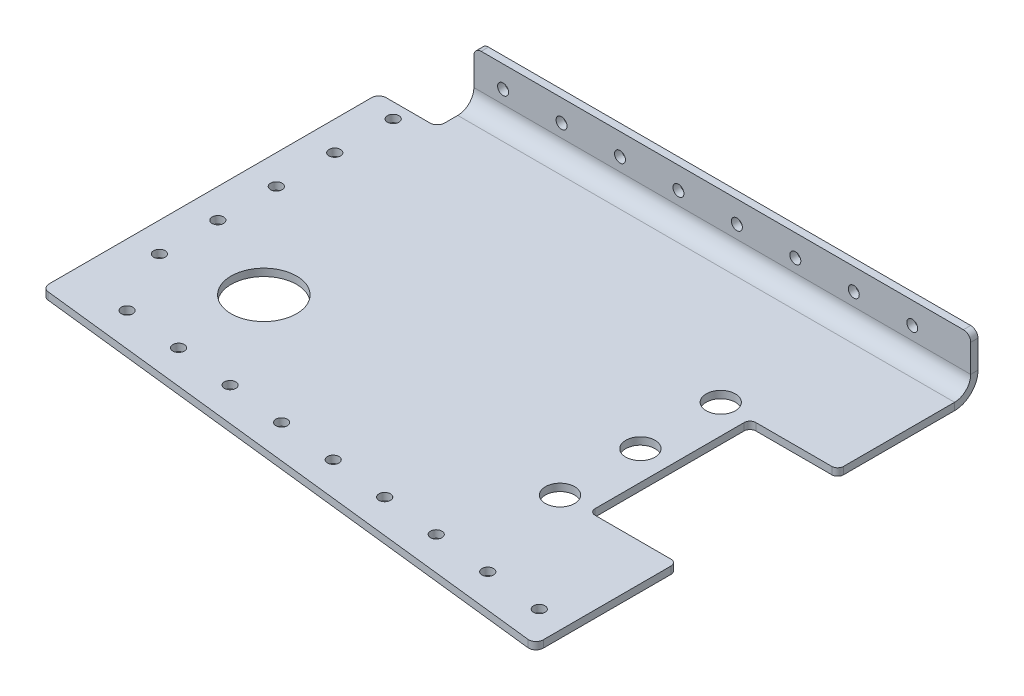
ISO-10303-21;
HEADER;
FILE_DESCRIPTION(('STEP AP214'),'2;1');
FILE_NAME('part.step','',(''),(''),'','','');
FILE_SCHEMA(('AUTOMOTIVE_DESIGN { 1 0 10303 214 1 1 1 1 }'));
ENDSEC;
DATA;
#1=APPLICATION_CONTEXT('core data for automotive mechanical design processes');
#2=APPLICATION_PROTOCOL_DEFINITION('international standard','automotive_design',2000,#1);
#3=PRODUCT_CONTEXT('',#1,'mechanical');
#4=PRODUCT('Part','Part','',(#3));
#5=PRODUCT_RELATED_PRODUCT_CATEGORY('part','',(#4));
#6=PRODUCT_DEFINITION_FORMATION('','',#4);
#7=PRODUCT_DEFINITION_CONTEXT('part definition',#1,'design');
#8=PRODUCT_DEFINITION('design','',#6,#7);
#9=PRODUCT_DEFINITION_SHAPE('','',#8);
#10=(LENGTH_UNIT() NAMED_UNIT(*) SI_UNIT(.MILLI.,.METRE.));
#11=(NAMED_UNIT(*) PLANE_ANGLE_UNIT() SI_UNIT($,.RADIAN.));
#12=(NAMED_UNIT(*) SI_UNIT($,.STERADIAN.) SOLID_ANGLE_UNIT());
#13=UNCERTAINTY_MEASURE_WITH_UNIT(LENGTH_MEASURE(1.E-05),#10,'distance_accuracy_value','');
#14=(GEOMETRIC_REPRESENTATION_CONTEXT(3) GLOBAL_UNCERTAINTY_ASSIGNED_CONTEXT((#13)) GLOBAL_UNIT_ASSIGNED_CONTEXT((#10,
#11,#12)) REPRESENTATION_CONTEXT('',''));
#15=CARTESIAN_POINT('',(0.,0.,0.));
#16=DIRECTION('',(0.,0.,1.));
#17=DIRECTION('',(1.,0.,0.));
#18=AXIS2_PLACEMENT_3D('',#15,#16,#17);
#19=CARTESIAN_POINT('',(241.3,-3.175,-213.614));
#20=DIRECTION('',(1.,0.,0.));
#21=DIRECTION('',(0.,0.,-1.));
#22=AXIS2_PLACEMENT_3D('',#19,#20,#21);
#23=PLANE('',#22);
#24=DIRECTION('',(0.,0.,-1.));
#25=VECTOR('',#24,1.);
#26=CARTESIAN_POINT('',(241.3,-3.175,-213.614));
#27=LINE('',#26,#25);
#28=CARTESIAN_POINT('',(241.3,-3.175,-24.7047113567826));
#29=VERTEX_POINT('',#28);
#30=CARTESIAN_POINT('',(241.3,-3.175,-80.249));
#31=VERTEX_POINT('',#30);
#32=EDGE_CURVE('E391',#29,#31,#27,.T.);
#33=ORIENTED_EDGE('',*,*,#32,.T.);
#34=DIRECTION('',(0.,-1.,0.));
#35=VECTOR('',#34,1.);
#36=CARTESIAN_POINT('',(241.3,0.,-80.249));
#37=LINE('',#36,#35);
#38=CARTESIAN_POINT('',(241.3,0.,-80.249));
#39=VERTEX_POINT('',#38);
#40=EDGE_CURVE('E466',#31,#39,#37,.F.);
#41=ORIENTED_EDGE('',*,*,#40,.T.);
#42=DIRECTION('',(0.,0.,-1.));
#43=VECTOR('',#42,1.);
#44=CARTESIAN_POINT('',(241.3,0.,-213.614));
#45=LINE('',#44,#43);
#46=CARTESIAN_POINT('',(241.3,0.,-24.7047113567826));
#47=VERTEX_POINT('',#46);
#48=EDGE_CURVE('E399',#47,#39,#45,.T.);
#49=ORIENTED_EDGE('',*,*,#48,.F.);
#50=DIRECTION('',(0.,-1.,0.));
#51=VECTOR('',#50,1.);
#52=CARTESIAN_POINT('',(241.3,-3.175,-24.7047113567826));
#53=LINE('',#52,#51);
#54=EDGE_CURVE('E412',#47,#29,#53,.T.);
#55=ORIENTED_EDGE('',*,*,#54,.T.);
#56=EDGE_LOOP('',(#33,#41,#49,#55));
#57=FACE_BOUND('',#56,.T.);
#58=ADVANCED_FACE('F58',(#57),#23,.T.);
#59=CARTESIAN_POINT('',(0.,-3.175,0.));
#60=DIRECTION('',(0.,-1.,0.));
#61=DIRECTION('',(0.,0.,-1.));
#62=AXIS2_PLACEMENT_3D('',#59,#60,#61);
#63=PLANE('',#62);
#64=CARTESIAN_POINT('',(50.8,-3.175,-93.7818881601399));
#65=DIRECTION('',(0.,-1.,0.));
#66=DIRECTION('',(0.,0.,-1.));
#67=AXIS2_PLACEMENT_3D('',#64,#65,#66);
#68=CIRCLE('',#67,14.224);
#69=CARTESIAN_POINT('',(50.8,-3.175,-108.00588816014));
#70=VERTEX_POINT('',#69);
#71=EDGE_CURVE('E832',#70,#70,#68,.T.);
#72=ORIENTED_EDGE('',*,*,#71,.F.);
#73=EDGE_LOOP('',(#72));
#74=FACE_BOUND('',#73,.T.);
#75=DIRECTION('',(-1.,0.,0.));
#76=VECTOR('',#75,1.);
#77=CARTESIAN_POINT('',(203.2,-3.175,-82.789));
#78=LINE('',#77,#76);
#79=CARTESIAN_POINT('',(238.76,-3.175,-82.789));
#80=VERTEX_POINT('',#79);
#81=CARTESIAN_POINT('',(205.74,-3.175,-82.789));
#82=VERTEX_POINT('',#81);
#83=EDGE_CURVE('E516',#80,#82,#78,.T.);
#84=ORIENTED_EDGE('',*,*,#83,.F.);
#85=CARTESIAN_POINT('',(238.76,-3.175,-80.249));
#86=DIRECTION('',(0.,-1.,0.));
#87=DIRECTION('',(0.,0.,-1.));
#88=AXIS2_PLACEMENT_3D('',#85,#86,#87);
#89=CIRCLE('',#88,2.54);
#90=EDGE_CURVE('E464',#80,#31,#89,.T.);
#91=ORIENTED_EDGE('',*,*,#90,.T.);
#92=ORIENTED_EDGE('',*,*,#32,.F.);
#93=CARTESIAN_POINT('',(238.125,-3.175,-24.7047113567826));
#94=DIRECTION('',(0.,-1.,0.));
#95=DIRECTION('',(0.,0.,-1.));
#96=AXIS2_PLACEMENT_3D('',#93,#94,#95);
#97=CIRCLE('',#96,3.175);
#98=CARTESIAN_POINT('',(237.76879536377,-3.175,-21.5497560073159));
#99=VERTEX_POINT('',#98);
#100=EDGE_CURVE('E419',#29,#99,#97,.T.);
#101=ORIENTED_EDGE('',*,*,#100,.T.);
#102=DIRECTION('',(-0.993686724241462,0.,-0.112190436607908));
#103=VECTOR('',#102,1.);
#104=CARTESIAN_POINT('',(0.,-3.175,-48.3946199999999));
#105=LINE('',#104,#103);
#106=CARTESIAN_POINT('',(2.81879536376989,-3.175,-48.076368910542));
#107=VERTEX_POINT('',#106);
#108=EDGE_CURVE('E301',#99,#107,#105,.T.);
#109=ORIENTED_EDGE('',*,*,#108,.T.);
#110=CARTESIAN_POINT('',(3.175,-3.175,-51.2313242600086));
#111=DIRECTION('',(0.,-1.,0.));
#112=DIRECTION('',(0.,0.,-1.));
#113=AXIS2_PLACEMENT_3D('',#110,#111,#112);
#114=CIRCLE('',#113,3.175);
#115=CARTESIAN_POINT('',(0.,-3.175,-51.2313242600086));
#116=VERTEX_POINT('',#115);
#117=EDGE_CURVE('E415',#107,#116,#114,.T.);
#118=ORIENTED_EDGE('',*,*,#117,.T.);
#119=DIRECTION('',(0.,0.,1.));
#120=VECTOR('',#119,1.);
#121=CARTESIAN_POINT('',(0.,-3.175,0.));
#122=LINE('',#121,#120);
#123=CARTESIAN_POINT('',(0.,-3.175,-191.389));
#124=VERTEX_POINT('',#123);
#125=EDGE_CURVE('E394',#124,#116,#122,.T.);
#126=ORIENTED_EDGE('',*,*,#125,.F.);
#127=CARTESIAN_POINT('',(3.175,-3.175,-191.389));
#128=DIRECTION('',(0.,-1.,0.));
#129=DIRECTION('',(0.,0.,-1.));
#130=AXIS2_PLACEMENT_3D('',#127,#128,#129);
#131=CIRCLE('',#130,3.175);
#132=CARTESIAN_POINT('',(3.175,-3.175,-194.564));
#133=VERTEX_POINT('',#132);
#134=EDGE_CURVE('E417',#124,#133,#131,.T.);
#135=ORIENTED_EDGE('',*,*,#134,.T.);
#136=DIRECTION('',(1.,0.,0.));
#137=VECTOR('',#136,1.);
#138=CARTESIAN_POINT('',(0.,-3.175,-194.564));
#139=LINE('',#138,#137);
#140=CARTESIAN_POINT('',(22.225,-3.175,-194.564));
#141=VERTEX_POINT('',#140);
#142=EDGE_CURVE('E291',#133,#141,#139,.T.);
#143=ORIENTED_EDGE('',*,*,#142,.T.);
#144=CARTESIAN_POINT('',(22.225,-3.175,-197.739));
#145=DIRECTION('',(0.,-1.,0.));
#146=DIRECTION('',(0.,0.,-1.));
#147=AXIS2_PLACEMENT_3D('',#144,#145,#146);
#148=CIRCLE('',#147,3.175);
#149=CARTESIAN_POINT('',(25.4,-3.175,-197.739));
#150=VERTEX_POINT('',#149);
#151=EDGE_CURVE('E455',#141,#150,#148,.F.);
#152=ORIENTED_EDGE('',*,*,#151,.T.);
#153=DIRECTION('',(0.,0.,-1.));
#154=VECTOR('',#153,1.);
#155=CARTESIAN_POINT('',(25.4,-3.175,-213.614));
#156=LINE('',#155,#154);
#157=CARTESIAN_POINT('',(25.4,-3.17500000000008,-203.439));
#158=VERTEX_POINT('',#157);
#159=EDGE_CURVE('E294',#150,#158,#156,.T.);
#160=ORIENTED_EDGE('',*,*,#159,.T.);
#161=DIRECTION('',(-1.,0.,0.));
#162=VECTOR('',#161,1.);
#163=CARTESIAN_POINT('',(25.4,-3.17500000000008,-203.439));
#164=LINE('',#163,#162);
#165=CARTESIAN_POINT('',(241.3,-3.175,-203.439));
#166=VERTEX_POINT('',#165);
#167=EDGE_CURVE('E229',#158,#166,#164,.F.);
#168=ORIENTED_EDGE('',*,*,#167,.T.);
#169=CARTESIAN_POINT('',(241.3,-3.175,-155.179));
#170=VERTEX_POINT('',#169);
#171=EDGE_CURVE('E395',#170,#166,#27,.T.);
#172=ORIENTED_EDGE('',*,*,#171,.F.);
#173=CARTESIAN_POINT('',(238.76,-3.175,-155.179));
#174=DIRECTION('',(0.,-1.,0.));
#175=DIRECTION('',(0.,0.,-1.));
#176=AXIS2_PLACEMENT_3D('',#173,#174,#175);
#177=CIRCLE('',#176,2.54);
#178=CARTESIAN_POINT('',(238.76,-3.175,-152.639));
#179=VERTEX_POINT('',#178);
#180=EDGE_CURVE('E462',#170,#179,#177,.T.);
#181=ORIENTED_EDGE('',*,*,#180,.T.);
#182=DIRECTION('',(1.,0.,0.));
#183=VECTOR('',#182,1.);
#184=CARTESIAN_POINT('',(203.2,-3.175,-152.639));
#185=LINE('',#184,#183);
#186=CARTESIAN_POINT('',(205.74,-3.175,-152.639));
#187=VERTEX_POINT('',#186);
#188=EDGE_CURVE('E494',#187,#179,#185,.T.);
#189=ORIENTED_EDGE('',*,*,#188,.F.);
#190=CARTESIAN_POINT('',(205.74,-3.175,-150.099));
#191=DIRECTION('',(0.,-1.,0.));
#192=DIRECTION('',(0.,0.,-1.));
#193=AXIS2_PLACEMENT_3D('',#190,#191,#192);
#194=CIRCLE('',#193,2.54);
#195=CARTESIAN_POINT('',(203.2,-3.175,-150.099));
#196=VERTEX_POINT('',#195);
#197=EDGE_CURVE('E66',#187,#196,#194,.F.);
#198=ORIENTED_EDGE('',*,*,#197,.T.);
#199=DIRECTION('',(0.,0.,-1.));
#200=VECTOR('',#199,1.);
#201=CARTESIAN_POINT('',(203.2,-3.175,-152.639));
#202=LINE('',#201,#200);
#203=CARTESIAN_POINT('',(203.2,-3.175,-85.329));
#204=VERTEX_POINT('',#203);
#205=EDGE_CURVE('E493',#204,#196,#202,.T.);
#206=ORIENTED_EDGE('',*,*,#205,.F.);
#207=CARTESIAN_POINT('',(205.74,-3.175,-85.329));
#208=DIRECTION('',(0.,-1.,0.));
#209=DIRECTION('',(0.,0.,-1.));
#210=AXIS2_PLACEMENT_3D('',#207,#208,#209);
#211=CIRCLE('',#210,2.54);
#212=EDGE_CURVE('E483',#204,#82,#211,.F.);
#213=ORIENTED_EDGE('',*,*,#212,.T.);
#214=EDGE_LOOP('',(#84,#91,#92,#101,#109,#118,#126,#135,#143,#152,#160,#168,#172,#181,#189,#198,
#206,#213));
#215=FACE_BOUND('',#214,.T.);
#216=CARTESIAN_POINT('',(190.5,-3.175,-117.714));
#217=DIRECTION('',(0.,-1.,0.));
#218=DIRECTION('',(0.,0.,-1.));
#219=AXIS2_PLACEMENT_3D('',#216,#217,#218);
#220=CIRCLE('',#219,6.34999999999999);
#221=CARTESIAN_POINT('',(190.5,-3.175,-124.064));
#222=VERTEX_POINT('',#221);
#223=EDGE_CURVE('E514',#222,#222,#220,.T.);
#224=ORIENTED_EDGE('',*,*,#223,.F.);
#225=EDGE_LOOP('',(#224));
#226=FACE_BOUND('',#225,.T.);
#227=CARTESIAN_POINT('',(190.5,-3.175,-82.789));
#228=DIRECTION('',(0.,-1.,0.));
#229=DIRECTION('',(0.,0.,-1.));
#230=AXIS2_PLACEMENT_3D('',#227,#228,#229);
#231=CIRCLE('',#230,6.34999999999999);
#232=CARTESIAN_POINT('',(190.5,-3.175,-89.139));
#233=VERTEX_POINT('',#232);
#234=EDGE_CURVE('E526',#233,#233,#231,.T.);
#235=ORIENTED_EDGE('',*,*,#234,.F.);
#236=EDGE_LOOP('',(#235));
#237=FACE_BOUND('',#236,.T.);
#238=CARTESIAN_POINT('',(190.5,-3.175,-152.639));
#239=DIRECTION('',(0.,-1.,0.));
#240=DIRECTION('',(0.,0.,-1.));
#241=AXIS2_PLACEMENT_3D('',#238,#239,#240);
#242=CIRCLE('',#241,6.34999999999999);
#243=CARTESIAN_POINT('',(190.5,-3.175,-158.989));
#244=VERTEX_POINT('',#243);
#245=EDGE_CURVE('E532',#244,#244,#242,.T.);
#246=ORIENTED_EDGE('',*,*,#245,.F.);
#247=EDGE_LOOP('',(#246));
#248=FACE_BOUND('',#247,.T.);
#249=CARTESIAN_POINT('',(12.7000000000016,-3.175,-188.09462));
#250=DIRECTION('',(0.,1.,0.));
#251=DIRECTION('',(0.,0.,1.));
#252=AXIS2_PLACEMENT_3D('',#249,#250,#251);
#253=CIRCLE('',#252,2.48919999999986);
#254=CARTESIAN_POINT('',(12.7000000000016,-3.175,-185.60542));
#255=VERTEX_POINT('',#254);
#256=EDGE_CURVE('E304',#255,#255,#253,.T.);
#257=ORIENTED_EDGE('',*,*,#256,.T.);
#258=EDGE_LOOP('',(#257));
#259=FACE_BOUND('',#258,.T.);
#260=CARTESIAN_POINT('',(12.7000000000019,-3.175,-162.69462));
#261=DIRECTION('',(0.,1.,0.));
#262=DIRECTION('',(0.,0.,1.));
#263=AXIS2_PLACEMENT_3D('',#260,#261,#262);
#264=CIRCLE('',#263,2.48919999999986);
#265=CARTESIAN_POINT('',(12.7000000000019,-3.175,-160.20542));
#266=VERTEX_POINT('',#265);
#267=EDGE_CURVE('E310',#266,#266,#264,.T.);
#268=ORIENTED_EDGE('',*,*,#267,.T.);
#269=EDGE_LOOP('',(#268));
#270=FACE_BOUND('',#269,.T.);
#271=CARTESIAN_POINT('',(12.7000000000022,-3.175,-137.29462));
#272=DIRECTION('',(0.,1.,0.));
#273=DIRECTION('',(0.,0.,1.));
#274=AXIS2_PLACEMENT_3D('',#271,#272,#273);
#275=CIRCLE('',#274,2.48919999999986);
#276=CARTESIAN_POINT('',(12.7000000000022,-3.175,-134.80542));
#277=VERTEX_POINT('',#276);
#278=EDGE_CURVE('E316',#277,#277,#275,.T.);
#279=ORIENTED_EDGE('',*,*,#278,.T.);
#280=EDGE_LOOP('',(#279));
#281=FACE_BOUND('',#280,.T.);
#282=CARTESIAN_POINT('',(12.7000000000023,-3.175,-111.89462));
#283=DIRECTION('',(0.,1.,0.));
#284=DIRECTION('',(0.,0.,1.));
#285=AXIS2_PLACEMENT_3D('',#282,#283,#284);
#286=CIRCLE('',#285,2.48919999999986);
#287=CARTESIAN_POINT('',(12.7000000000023,-3.175,-109.40542));
#288=VERTEX_POINT('',#287);
#289=EDGE_CURVE('E322',#288,#288,#286,.T.);
#290=ORIENTED_EDGE('',*,*,#289,.T.);
#291=EDGE_LOOP('',(#290));
#292=FACE_BOUND('',#291,.T.);
#293=CARTESIAN_POINT('',(12.7000000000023,-3.175,-86.4946199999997));
#294=DIRECTION('',(0.,1.,0.));
#295=DIRECTION('',(0.,0.,1.));
#296=AXIS2_PLACEMENT_3D('',#293,#294,#295);
#297=CIRCLE('',#296,2.48919999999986);
#298=CARTESIAN_POINT('',(12.7000000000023,-3.175,-84.0054199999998));
#299=VERTEX_POINT('',#298);
#300=EDGE_CURVE('E328',#299,#299,#297,.T.);
#301=ORIENTED_EDGE('',*,*,#300,.T.);
#302=EDGE_LOOP('',(#301));
#303=FACE_BOUND('',#302,.T.);
#304=CARTESIAN_POINT('',(26.9604964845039,-3.175,-58.1869653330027));
#305=DIRECTION('',(0.,1.,0.));
#306=DIRECTION('',(0.,0.,1.));
#307=AXIS2_PLACEMENT_3D('',#304,#305,#306);
#308=CIRCLE('',#307,2.48919999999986);
#309=CARTESIAN_POINT('',(26.9604964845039,-3.175,-55.6977653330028));
#310=VERTEX_POINT('',#309);
#311=EDGE_CURVE('E334',#310,#310,#308,.T.);
#312=ORIENTED_EDGE('',*,*,#311,.T.);
#313=EDGE_LOOP('',(#312));
#314=FACE_BOUND('',#313,.T.);
#315=CARTESIAN_POINT('',(52.200139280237,-3.175,-55.3373282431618));
#316=DIRECTION('',(0.,1.,0.));
#317=DIRECTION('',(0.,0.,1.));
#318=AXIS2_PLACEMENT_3D('',#315,#316,#317);
#319=CIRCLE('',#318,2.48919999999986);
#320=CARTESIAN_POINT('',(52.200139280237,-3.175,-52.848128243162));
#321=VERTEX_POINT('',#320);
#322=EDGE_CURVE('E340',#321,#321,#319,.T.);
#323=ORIENTED_EDGE('',*,*,#322,.T.);
#324=EDGE_LOOP('',(#323));
#325=FACE_BOUND('',#324,.T.);
#326=CARTESIAN_POINT('',(77.4397820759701,-3.175,-52.487691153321));
#327=DIRECTION('',(0.,1.,0.));
#328=DIRECTION('',(0.,0.,1.));
#329=AXIS2_PLACEMENT_3D('',#326,#327,#328);
#330=CIRCLE('',#329,2.48919999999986);
#331=CARTESIAN_POINT('',(77.4397820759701,-3.175,-49.9984911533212));
#332=VERTEX_POINT('',#331);
#333=EDGE_CURVE('E346',#332,#332,#330,.T.);
#334=ORIENTED_EDGE('',*,*,#333,.T.);
#335=EDGE_LOOP('',(#334));
#336=FACE_BOUND('',#335,.T.);
#337=CARTESIAN_POINT('',(102.679424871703,-3.175,-49.6380540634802));
#338=DIRECTION('',(0.,1.,0.));
#339=DIRECTION('',(0.,0.,1.));
#340=AXIS2_PLACEMENT_3D('',#337,#338,#339);
#341=CIRCLE('',#340,2.48919999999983);
#342=CARTESIAN_POINT('',(102.679424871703,-3.175,-47.1488540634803));
#343=VERTEX_POINT('',#342);
#344=EDGE_CURVE('E352',#343,#343,#341,.T.);
#345=ORIENTED_EDGE('',*,*,#344,.T.);
#346=EDGE_LOOP('',(#345));
#347=FACE_BOUND('',#346,.T.);
#348=CARTESIAN_POINT('',(127.919067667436,-3.175,-46.7884169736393));
#349=DIRECTION('',(0.,1.,0.));
#350=DIRECTION('',(0.,0.,1.));
#351=AXIS2_PLACEMENT_3D('',#348,#349,#350);
#352=CIRCLE('',#351,2.48919999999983);
#353=CARTESIAN_POINT('',(127.919067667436,-3.175,-44.2992169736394));
#354=VERTEX_POINT('',#353);
#355=EDGE_CURVE('E358',#354,#354,#352,.T.);
#356=ORIENTED_EDGE('',*,*,#355,.T.);
#357=EDGE_LOOP('',(#356));
#358=FACE_BOUND('',#357,.T.);
#359=CARTESIAN_POINT('',(153.15871046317,-3.175,-43.9387798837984));
#360=DIRECTION('',(0.,1.,0.));
#361=DIRECTION('',(0.,0.,1.));
#362=AXIS2_PLACEMENT_3D('',#359,#360,#361);
#363=CIRCLE('',#362,2.48919999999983);
#364=CARTESIAN_POINT('',(153.15871046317,-3.175,-41.4495798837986));
#365=VERTEX_POINT('',#364);
#366=EDGE_CURVE('E364',#365,#365,#363,.T.);
#367=ORIENTED_EDGE('',*,*,#366,.T.);
#368=EDGE_LOOP('',(#367));
#369=FACE_BOUND('',#368,.T.);
#370=CARTESIAN_POINT('',(178.398353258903,-3.175,-41.0891427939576));
#371=DIRECTION('',(0.,1.,0.));
#372=DIRECTION('',(0.,0.,1.));
#373=AXIS2_PLACEMENT_3D('',#370,#371,#372);
#374=CIRCLE('',#373,2.48919999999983);
#375=CARTESIAN_POINT('',(178.398353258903,-3.175,-38.5999427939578));
#376=VERTEX_POINT('',#375);
#377=EDGE_CURVE('E370',#376,#376,#374,.T.);
#378=ORIENTED_EDGE('',*,*,#377,.T.);
#379=EDGE_LOOP('',(#378));
#380=FACE_BOUND('',#379,.T.);
#381=CARTESIAN_POINT('',(203.637996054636,-3.175,-38.2395057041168));
#382=DIRECTION('',(0.,1.,0.));
#383=DIRECTION('',(0.,0.,1.));
#384=AXIS2_PLACEMENT_3D('',#381,#382,#383);
#385=CIRCLE('',#384,2.48919999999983);
#386=CARTESIAN_POINT('',(203.637996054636,-3.175,-35.7503057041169));
#387=VERTEX_POINT('',#386);
#388=EDGE_CURVE('E376',#387,#387,#385,.T.);
#389=ORIENTED_EDGE('',*,*,#388,.T.);
#390=EDGE_LOOP('',(#389));
#391=FACE_BOUND('',#390,.T.);
#392=CARTESIAN_POINT('',(228.877638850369,-3.175,-35.3898686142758));
#393=DIRECTION('',(0.,1.,0.));
#394=DIRECTION('',(0.,0.,1.));
#395=AXIS2_PLACEMENT_3D('',#392,#393,#394);
#396=CIRCLE('',#395,2.48919999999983);
#397=CARTESIAN_POINT('',(228.877638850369,-3.175,-32.900668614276));
#398=VERTEX_POINT('',#397);
#399=EDGE_CURVE('E382',#398,#398,#396,.T.);
#400=ORIENTED_EDGE('',*,*,#399,.T.);
#401=EDGE_LOOP('',(#400));
#402=FACE_BOUND('',#401,.T.);
#403=ADVANCED_FACE('F491',(#74,#215,#226,#237,#248,#259,#270,#281,#292,#303,#314,#325,#336,#347,
#358,#369,#380,#391,#402),#63,.T.);
#404=CARTESIAN_POINT('',(0.,0.,0.));
#405=DIRECTION('',(0.,-1.,0.));
#406=DIRECTION('',(0.,0.,-1.));
#407=AXIS2_PLACEMENT_3D('',#404,#405,#406);
#408=PLANE('',#407);
#409=CARTESIAN_POINT('',(50.8,0.,-93.7818881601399));
#410=DIRECTION('',(0.,-1.,0.));
#411=DIRECTION('',(0.,0.,-1.));
#412=AXIS2_PLACEMENT_3D('',#409,#410,#411);
#413=CIRCLE('',#412,14.224);
#414=CARTESIAN_POINT('',(50.8,0.,-108.00588816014));
#415=VERTEX_POINT('',#414);
#416=EDGE_CURVE('E503',#415,#415,#413,.T.);
#417=ORIENTED_EDGE('',*,*,#416,.T.);
#418=EDGE_LOOP('',(#417));
#419=FACE_BOUND('',#418,.T.);
#420=CARTESIAN_POINT('',(190.5,0.,-117.714));
#421=DIRECTION('',(0.,-1.,0.));
#422=DIRECTION('',(0.,0.,-1.));
#423=AXIS2_PLACEMENT_3D('',#420,#421,#422);
#424=CIRCLE('',#423,6.34999999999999);
#425=CARTESIAN_POINT('',(190.5,0.,-124.064));
#426=VERTEX_POINT('',#425);
#427=EDGE_CURVE('E523',#426,#426,#424,.T.);
#428=ORIENTED_EDGE('',*,*,#427,.T.);
#429=EDGE_LOOP('',(#428));
#430=FACE_BOUND('',#429,.T.);
#431=CARTESIAN_POINT('',(190.5,0.,-82.789));
#432=DIRECTION('',(0.,-1.,0.));
#433=DIRECTION('',(0.,0.,-1.));
#434=AXIS2_PLACEMENT_3D('',#431,#432,#433);
#435=CIRCLE('',#434,6.34999999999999);
#436=CARTESIAN_POINT('',(190.5,0.,-89.139));
#437=VERTEX_POINT('',#436);
#438=EDGE_CURVE('E529',#437,#437,#435,.T.);
#439=ORIENTED_EDGE('',*,*,#438,.T.);
#440=EDGE_LOOP('',(#439));
#441=FACE_BOUND('',#440,.T.);
#442=CARTESIAN_POINT('',(190.5,0.,-152.639));
#443=DIRECTION('',(0.,-1.,0.));
#444=DIRECTION('',(0.,0.,-1.));
#445=AXIS2_PLACEMENT_3D('',#442,#443,#444);
#446=CIRCLE('',#445,6.34999999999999);
#447=CARTESIAN_POINT('',(190.5,0.,-158.989));
#448=VERTEX_POINT('',#447);
#449=EDGE_CURVE('E535',#448,#448,#446,.T.);
#450=ORIENTED_EDGE('',*,*,#449,.T.);
#451=EDGE_LOOP('',(#450));
#452=FACE_BOUND('',#451,.T.);
#453=CARTESIAN_POINT('',(12.7000000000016,0.,-188.09462));
#454=DIRECTION('',(0.,1.,0.));
#455=DIRECTION('',(0.,0.,1.));
#456=AXIS2_PLACEMENT_3D('',#453,#454,#455);
#457=CIRCLE('',#456,2.48919999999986);
#458=CARTESIAN_POINT('',(12.7000000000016,0.,-185.60542));
#459=VERTEX_POINT('',#458);
#460=EDGE_CURVE('E307',#459,#459,#457,.T.);
#461=ORIENTED_EDGE('',*,*,#460,.F.);
#462=EDGE_LOOP('',(#461));
#463=FACE_BOUND('',#462,.T.);
#464=CARTESIAN_POINT('',(12.7000000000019,0.,-162.69462));
#465=DIRECTION('',(0.,1.,0.));
#466=DIRECTION('',(0.,0.,1.));
#467=AXIS2_PLACEMENT_3D('',#464,#465,#466);
#468=CIRCLE('',#467,2.48919999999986);
#469=CARTESIAN_POINT('',(12.7000000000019,0.,-160.20542));
#470=VERTEX_POINT('',#469);
#471=EDGE_CURVE('E313',#470,#470,#468,.T.);
#472=ORIENTED_EDGE('',*,*,#471,.F.);
#473=EDGE_LOOP('',(#472));
#474=FACE_BOUND('',#473,.T.);
#475=CARTESIAN_POINT('',(12.7000000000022,0.,-137.29462));
#476=DIRECTION('',(0.,1.,0.));
#477=DIRECTION('',(0.,0.,1.));
#478=AXIS2_PLACEMENT_3D('',#475,#476,#477);
#479=CIRCLE('',#478,2.48919999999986);
#480=CARTESIAN_POINT('',(12.7000000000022,0.,-134.80542));
#481=VERTEX_POINT('',#480);
#482=EDGE_CURVE('E319',#481,#481,#479,.T.);
#483=ORIENTED_EDGE('',*,*,#482,.F.);
#484=EDGE_LOOP('',(#483));
#485=FACE_BOUND('',#484,.T.);
#486=CARTESIAN_POINT('',(12.7000000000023,0.,-111.89462));
#487=DIRECTION('',(0.,1.,0.));
#488=DIRECTION('',(0.,0.,1.));
#489=AXIS2_PLACEMENT_3D('',#486,#487,#488);
#490=CIRCLE('',#489,2.48919999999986);
#491=CARTESIAN_POINT('',(12.7000000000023,0.,-109.40542));
#492=VERTEX_POINT('',#491);
#493=EDGE_CURVE('E325',#492,#492,#490,.T.);
#494=ORIENTED_EDGE('',*,*,#493,.F.);
#495=EDGE_LOOP('',(#494));
#496=FACE_BOUND('',#495,.T.);
#497=CARTESIAN_POINT('',(12.7000000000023,0.,-86.4946199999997));
#498=DIRECTION('',(0.,1.,0.));
#499=DIRECTION('',(0.,0.,1.));
#500=AXIS2_PLACEMENT_3D('',#497,#498,#499);
#501=CIRCLE('',#500,2.48919999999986);
#502=CARTESIAN_POINT('',(12.7000000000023,0.,-84.0054199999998));
#503=VERTEX_POINT('',#502);
#504=EDGE_CURVE('E331',#503,#503,#501,.T.);
#505=ORIENTED_EDGE('',*,*,#504,.F.);
#506=EDGE_LOOP('',(#505));
#507=FACE_BOUND('',#506,.T.);
#508=CARTESIAN_POINT('',(26.9604964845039,0.,-58.1869653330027));
#509=DIRECTION('',(0.,1.,0.));
#510=DIRECTION('',(0.,0.,1.));
#511=AXIS2_PLACEMENT_3D('',#508,#509,#510);
#512=CIRCLE('',#511,2.48919999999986);
#513=CARTESIAN_POINT('',(26.9604964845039,0.,-55.6977653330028));
#514=VERTEX_POINT('',#513);
#515=EDGE_CURVE('E337',#514,#514,#512,.T.);
#516=ORIENTED_EDGE('',*,*,#515,.F.);
#517=EDGE_LOOP('',(#516));
#518=FACE_BOUND('',#517,.T.);
#519=CARTESIAN_POINT('',(52.200139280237,0.,-55.3373282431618));
#520=DIRECTION('',(0.,1.,0.));
#521=DIRECTION('',(0.,0.,1.));
#522=AXIS2_PLACEMENT_3D('',#519,#520,#521);
#523=CIRCLE('',#522,2.48919999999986);
#524=CARTESIAN_POINT('',(52.200139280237,0.,-52.848128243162));
#525=VERTEX_POINT('',#524);
#526=EDGE_CURVE('E343',#525,#525,#523,.T.);
#527=ORIENTED_EDGE('',*,*,#526,.F.);
#528=EDGE_LOOP('',(#527));
#529=FACE_BOUND('',#528,.T.);
#530=CARTESIAN_POINT('',(77.4397820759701,0.,-52.487691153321));
#531=DIRECTION('',(0.,1.,0.));
#532=DIRECTION('',(0.,0.,1.));
#533=AXIS2_PLACEMENT_3D('',#530,#531,#532);
#534=CIRCLE('',#533,2.48919999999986);
#535=CARTESIAN_POINT('',(77.4397820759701,0.,-49.9984911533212));
#536=VERTEX_POINT('',#535);
#537=EDGE_CURVE('E349',#536,#536,#534,.T.);
#538=ORIENTED_EDGE('',*,*,#537,.F.);
#539=EDGE_LOOP('',(#538));
#540=FACE_BOUND('',#539,.T.);
#541=CARTESIAN_POINT('',(102.679424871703,0.,-49.6380540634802));
#542=DIRECTION('',(0.,1.,0.));
#543=DIRECTION('',(0.,0.,1.));
#544=AXIS2_PLACEMENT_3D('',#541,#542,#543);
#545=CIRCLE('',#544,2.48919999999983);
#546=CARTESIAN_POINT('',(102.679424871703,0.,-47.1488540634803));
#547=VERTEX_POINT('',#546);
#548=EDGE_CURVE('E355',#547,#547,#545,.T.);
#549=ORIENTED_EDGE('',*,*,#548,.F.);
#550=EDGE_LOOP('',(#549));
#551=FACE_BOUND('',#550,.T.);
#552=CARTESIAN_POINT('',(127.919067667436,0.,-46.7884169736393));
#553=DIRECTION('',(0.,1.,0.));
#554=DIRECTION('',(0.,0.,1.));
#555=AXIS2_PLACEMENT_3D('',#552,#553,#554);
#556=CIRCLE('',#555,2.48919999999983);
#557=CARTESIAN_POINT('',(127.919067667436,0.,-44.2992169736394));
#558=VERTEX_POINT('',#557);
#559=EDGE_CURVE('E361',#558,#558,#556,.T.);
#560=ORIENTED_EDGE('',*,*,#559,.F.);
#561=EDGE_LOOP('',(#560));
#562=FACE_BOUND('',#561,.T.);
#563=CARTESIAN_POINT('',(153.15871046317,0.,-43.9387798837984));
#564=DIRECTION('',(0.,1.,0.));
#565=DIRECTION('',(0.,0.,1.));
#566=AXIS2_PLACEMENT_3D('',#563,#564,#565);
#567=CIRCLE('',#566,2.48919999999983);
#568=CARTESIAN_POINT('',(153.15871046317,0.,-41.4495798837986));
#569=VERTEX_POINT('',#568);
#570=EDGE_CURVE('E367',#569,#569,#567,.T.);
#571=ORIENTED_EDGE('',*,*,#570,.F.);
#572=EDGE_LOOP('',(#571));
#573=FACE_BOUND('',#572,.T.);
#574=CARTESIAN_POINT('',(178.398353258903,0.,-41.0891427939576));
#575=DIRECTION('',(0.,1.,0.));
#576=DIRECTION('',(0.,0.,1.));
#577=AXIS2_PLACEMENT_3D('',#574,#575,#576);
#578=CIRCLE('',#577,2.48919999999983);
#579=CARTESIAN_POINT('',(178.398353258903,0.,-38.5999427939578));
#580=VERTEX_POINT('',#579);
#581=EDGE_CURVE('E373',#580,#580,#578,.T.);
#582=ORIENTED_EDGE('',*,*,#581,.F.);
#583=EDGE_LOOP('',(#582));
#584=FACE_BOUND('',#583,.T.);
#585=CARTESIAN_POINT('',(203.637996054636,0.,-38.2395057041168));
#586=DIRECTION('',(0.,1.,0.));
#587=DIRECTION('',(0.,0.,1.));
#588=AXIS2_PLACEMENT_3D('',#585,#586,#587);
#589=CIRCLE('',#588,2.48919999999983);
#590=CARTESIAN_POINT('',(203.637996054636,0.,-35.7503057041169));
#591=VERTEX_POINT('',#590);
#592=EDGE_CURVE('E379',#591,#591,#589,.T.);
#593=ORIENTED_EDGE('',*,*,#592,.F.);
#594=EDGE_LOOP('',(#593));
#595=FACE_BOUND('',#594,.T.);
#596=CARTESIAN_POINT('',(228.877638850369,0.,-35.3898686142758));
#597=DIRECTION('',(0.,1.,0.));
#598=DIRECTION('',(0.,0.,1.));
#599=AXIS2_PLACEMENT_3D('',#596,#597,#598);
#600=CIRCLE('',#599,2.48919999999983);
#601=CARTESIAN_POINT('',(228.877638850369,0.,-32.900668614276));
#602=VERTEX_POINT('',#601);
#603=EDGE_CURVE('E385',#602,#602,#600,.T.);
#604=ORIENTED_EDGE('',*,*,#603,.F.);
#605=EDGE_LOOP('',(#604));
#606=FACE_BOUND('',#605,.T.);
#607=ORIENTED_EDGE('',*,*,#48,.T.);
#608=CARTESIAN_POINT('',(238.76,0.,-80.249));
#609=DIRECTION('',(0.,-1.,0.));
#610=DIRECTION('',(0.,0.,-1.));
#611=AXIS2_PLACEMENT_3D('',#608,#609,#610);
#612=CIRCLE('',#611,2.54);
#613=CARTESIAN_POINT('',(238.76,0.,-82.789));
#614=VERTEX_POINT('',#613);
#615=EDGE_CURVE('E469',#39,#614,#612,.F.);
#616=ORIENTED_EDGE('',*,*,#615,.T.);
#617=DIRECTION('',(-1.,0.,0.));
#618=VECTOR('',#617,1.);
#619=CARTESIAN_POINT('',(203.2,0.,-82.789));
#620=LINE('',#619,#618);
#621=CARTESIAN_POINT('',(205.74,0.,-82.789));
#622=VERTEX_POINT('',#621);
#623=EDGE_CURVE('E511',#614,#622,#620,.T.);
#624=ORIENTED_EDGE('',*,*,#623,.T.);
#625=CARTESIAN_POINT('',(205.74,0.,-85.329));
#626=DIRECTION('',(0.,-1.,0.));
#627=DIRECTION('',(0.,0.,-1.));
#628=AXIS2_PLACEMENT_3D('',#625,#626,#627);
#629=CIRCLE('',#628,2.54);
#630=CARTESIAN_POINT('',(203.2,0.,-85.329));
#631=VERTEX_POINT('',#630);
#632=EDGE_CURVE('E485',#622,#631,#629,.T.);
#633=ORIENTED_EDGE('',*,*,#632,.T.);
#634=DIRECTION('',(0.,0.,-1.));
#635=VECTOR('',#634,1.);
#636=CARTESIAN_POINT('',(203.2,0.,-152.639));
#637=LINE('',#636,#635);
#638=CARTESIAN_POINT('',(203.2,0.,-150.099));
#639=VERTEX_POINT('',#638);
#640=EDGE_CURVE('E509',#631,#639,#637,.T.);
#641=ORIENTED_EDGE('',*,*,#640,.T.);
#642=CARTESIAN_POINT('',(205.74,0.,-150.099));
#643=DIRECTION('',(0.,-1.,0.));
#644=DIRECTION('',(0.,0.,-1.));
#645=AXIS2_PLACEMENT_3D('',#642,#643,#644);
#646=CIRCLE('',#645,2.54);
#647=CARTESIAN_POINT('',(205.74,0.,-152.639));
#648=VERTEX_POINT('',#647);
#649=EDGE_CURVE('E13',#639,#648,#646,.T.);
#650=ORIENTED_EDGE('',*,*,#649,.T.);
#651=DIRECTION('',(1.,0.,0.));
#652=VECTOR('',#651,1.);
#653=CARTESIAN_POINT('',(203.2,0.,-152.639));
#654=LINE('',#653,#652);
#655=CARTESIAN_POINT('',(238.76,0.,-152.639));
#656=VERTEX_POINT('',#655);
#657=EDGE_CURVE('E508',#648,#656,#654,.T.);
#658=ORIENTED_EDGE('',*,*,#657,.T.);
#659=CARTESIAN_POINT('',(238.76,0.,-155.179));
#660=DIRECTION('',(0.,-1.,0.));
#661=DIRECTION('',(0.,0.,-1.));
#662=AXIS2_PLACEMENT_3D('',#659,#660,#661);
#663=CIRCLE('',#662,2.54);
#664=CARTESIAN_POINT('',(241.3,0.,-155.179));
#665=VERTEX_POINT('',#664);
#666=EDGE_CURVE('E73',#656,#665,#663,.F.);
#667=ORIENTED_EDGE('',*,*,#666,.T.);
#668=CARTESIAN_POINT('',(241.3,0.,-203.439));
#669=VERTEX_POINT('',#668);
#670=EDGE_CURVE('E388',#665,#669,#45,.T.);
#671=ORIENTED_EDGE('',*,*,#670,.T.);
#672=DIRECTION('',(-1.,0.,0.));
#673=VECTOR('',#672,1.);
#674=CARTESIAN_POINT('',(25.4,0.,-203.439));
#675=LINE('',#674,#673);
#676=CARTESIAN_POINT('',(25.4,0.,-203.439));
#677=VERTEX_POINT('',#676);
#678=EDGE_CURVE('E282',#677,#669,#675,.F.);
#679=ORIENTED_EDGE('',*,*,#678,.F.);
#680=DIRECTION('',(0.,0.,-1.));
#681=VECTOR('',#680,1.);
#682=CARTESIAN_POINT('',(25.4,0.,-213.614));
#683=LINE('',#682,#681);
#684=CARTESIAN_POINT('',(25.4,0.,-197.739));
#685=VERTEX_POINT('',#684);
#686=EDGE_CURVE('E295',#685,#677,#683,.T.);
#687=ORIENTED_EDGE('',*,*,#686,.F.);
#688=CARTESIAN_POINT('',(22.225,0.,-197.739));
#689=DIRECTION('',(0.,-1.,0.));
#690=DIRECTION('',(0.,0.,-1.));
#691=AXIS2_PLACEMENT_3D('',#688,#689,#690);
#692=CIRCLE('',#691,3.175);
#693=CARTESIAN_POINT('',(22.225,0.,-194.564));
#694=VERTEX_POINT('',#693);
#695=EDGE_CURVE('E453',#685,#694,#692,.T.);
#696=ORIENTED_EDGE('',*,*,#695,.T.);
#697=DIRECTION('',(1.,0.,0.));
#698=VECTOR('',#697,1.);
#699=CARTESIAN_POINT('',(0.,0.,-194.564));
#700=LINE('',#699,#698);
#701=CARTESIAN_POINT('',(3.175,0.,-194.564));
#702=VERTEX_POINT('',#701);
#703=EDGE_CURVE('E289',#702,#694,#700,.T.);
#704=ORIENTED_EDGE('',*,*,#703,.F.);
#705=CARTESIAN_POINT('',(3.175,0.,-191.389));
#706=DIRECTION('',(0.,-1.,0.));
#707=DIRECTION('',(0.,0.,-1.));
#708=AXIS2_PLACEMENT_3D('',#705,#706,#707);
#709=CIRCLE('',#708,3.175);
#710=CARTESIAN_POINT('',(0.,0.,-191.389));
#711=VERTEX_POINT('',#710);
#712=EDGE_CURVE('E428',#702,#711,#709,.F.);
#713=ORIENTED_EDGE('',*,*,#712,.T.);
#714=DIRECTION('',(0.,0.,1.));
#715=VECTOR('',#714,1.);
#716=CARTESIAN_POINT('',(0.,0.,0.));
#717=LINE('',#716,#715);
#718=CARTESIAN_POINT('',(0.,0.,-51.2313242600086));
#719=VERTEX_POINT('',#718);
#720=EDGE_CURVE('E402',#711,#719,#717,.T.);
#721=ORIENTED_EDGE('',*,*,#720,.T.);
#722=CARTESIAN_POINT('',(3.175,0.,-51.2313242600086));
#723=DIRECTION('',(0.,-1.,0.));
#724=DIRECTION('',(0.,0.,-1.));
#725=AXIS2_PLACEMENT_3D('',#722,#723,#724);
#726=CIRCLE('',#725,3.175);
#727=CARTESIAN_POINT('',(2.81879536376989,0.,-48.076368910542));
#728=VERTEX_POINT('',#727);
#729=EDGE_CURVE('E426',#719,#728,#726,.F.);
#730=ORIENTED_EDGE('',*,*,#729,.T.);
#731=DIRECTION('',(-0.993686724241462,0.,-0.112190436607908));
#732=VECTOR('',#731,1.);
#733=CARTESIAN_POINT('',(0.,0.,-48.3946199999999));
#734=LINE('',#733,#732);
#735=CARTESIAN_POINT('',(237.76879536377,0.,-21.5497560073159));
#736=VERTEX_POINT('',#735);
#737=EDGE_CURVE('E297',#736,#728,#734,.T.);
#738=ORIENTED_EDGE('',*,*,#737,.F.);
#739=CARTESIAN_POINT('',(238.125,0.,-24.7047113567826));
#740=DIRECTION('',(0.,-1.,0.));
#741=DIRECTION('',(0.,0.,-1.));
#742=AXIS2_PLACEMENT_3D('',#739,#740,#741);
#743=CIRCLE('',#742,3.175);
#744=EDGE_CURVE('E430',#736,#47,#743,.F.);
#745=ORIENTED_EDGE('',*,*,#744,.T.);
#746=EDGE_LOOP('',(#607,#616,#624,#633,#641,#650,#658,#667,#671,#679,#687,#696,#704,#713,#721,
#730,#738,#745));
#747=FACE_BOUND('',#746,.T.);
#748=ADVANCED_FACE('F507',(#419,#430,#441,#452,#463,#474,#485,#496,#507,#518,#529,#540,#551,
#562,#573,#584,#595,#606,#747),#408,.F.);
#749=CARTESIAN_POINT('',(25.4,-3.175,-213.614));
#750=DIRECTION('',(1.,0.,0.));
#751=DIRECTION('',(0.,0.,-1.));
#752=AXIS2_PLACEMENT_3D('',#749,#750,#751);
#753=PLANE('',#752);
#754=ORIENTED_EDGE('',*,*,#159,.F.);
#755=DIRECTION('',(0.,1.,0.));
#756=VECTOR('',#755,1.);
#757=CARTESIAN_POINT('',(25.4,0.,-197.739));
#758=LINE('',#757,#756);
#759=EDGE_CURVE('E398',#150,#685,#758,.T.);
#760=ORIENTED_EDGE('',*,*,#759,.T.);
#761=ORIENTED_EDGE('',*,*,#686,.T.);
#762=DIRECTION('',(0.,-1.,0.));
#763=VECTOR('',#762,1.);
#764=CARTESIAN_POINT('',(25.4,0.,-203.439));
#765=LINE('',#764,#763);
#766=EDGE_CURVE('E278',#677,#158,#765,.T.);
#767=ORIENTED_EDGE('',*,*,#766,.T.);
#768=EDGE_LOOP('',(#754,#760,#761,#767));
#769=FACE_BOUND('',#768,.T.);
#770=ADVANCED_FACE('F620',(#769),#753,.F.);
#771=CARTESIAN_POINT('',(0.,-3.175,0.));
#772=DIRECTION('',(-1.,0.,0.));
#773=DIRECTION('',(0.,0.,1.));
#774=AXIS2_PLACEMENT_3D('',#771,#772,#773);
#775=PLANE('',#774);
#776=ORIENTED_EDGE('',*,*,#720,.F.);
#777=DIRECTION('',(0.,1.,0.));
#778=VECTOR('',#777,1.);
#779=CARTESIAN_POINT('',(0.,-3.175,-191.389));
#780=LINE('',#779,#778);
#781=EDGE_CURVE('E451',#711,#124,#780,.F.);
#782=ORIENTED_EDGE('',*,*,#781,.T.);
#783=ORIENTED_EDGE('',*,*,#125,.T.);
#784=DIRECTION('',(0.,-1.,0.));
#785=VECTOR('',#784,1.);
#786=CARTESIAN_POINT('',(0.,-3.175,-51.2313242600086));
#787=LINE('',#786,#785);
#788=EDGE_CURVE('E449',#116,#719,#787,.F.);
#789=ORIENTED_EDGE('',*,*,#788,.T.);
#790=EDGE_LOOP('',(#776,#782,#783,#789));
#791=FACE_BOUND('',#790,.T.);
#792=ADVANCED_FACE('F636',(#791),#775,.T.);
#793=ORIENTED_EDGE('',*,*,#670,.F.);
#794=DIRECTION('',(0.,-1.,0.));
#795=VECTOR('',#794,1.);
#796=CARTESIAN_POINT('',(241.3,-3.175,-155.179));
#797=LINE('',#796,#795);
#798=EDGE_CURVE('E480',#665,#170,#797,.T.);
#799=ORIENTED_EDGE('',*,*,#798,.T.);
#800=ORIENTED_EDGE('',*,*,#171,.T.);
#801=DIRECTION('',(0.,-1.,0.));
#802=VECTOR('',#801,1.);
#803=CARTESIAN_POINT('',(241.3,0.,-203.439));
#804=LINE('',#803,#802);
#805=EDGE_CURVE('E286',#669,#166,#804,.T.);
#806=ORIENTED_EDGE('',*,*,#805,.F.);
#807=EDGE_LOOP('',(#793,#799,#800,#806));
#808=FACE_BOUND('',#807,.T.);
#809=ADVANCED_FACE('F613',(#808),#23,.T.);
#810=CARTESIAN_POINT('',(228.877638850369,-3.175,-35.3898686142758));
#811=DIRECTION('',(0.,1.,0.));
#812=DIRECTION('',(0.,0.,1.));
#813=AXIS2_PLACEMENT_3D('',#810,#811,#812);
#814=CYLINDRICAL_SURFACE('',#813,2.48919999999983);
#815=ORIENTED_EDGE('',*,*,#603,.T.);
#816=EDGE_LOOP('',(#815));
#817=FACE_BOUND('',#816,.T.);
#818=ORIENTED_EDGE('',*,*,#399,.F.);
#819=EDGE_LOOP('',(#818));
#820=FACE_BOUND('',#819,.T.);
#821=ADVANCED_FACE('F683',(#817,#820),#814,.F.);
#822=CARTESIAN_POINT('',(203.637996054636,-3.175,-38.2395057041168));
#823=DIRECTION('',(0.,1.,0.));
#824=DIRECTION('',(0.,0.,1.));
#825=AXIS2_PLACEMENT_3D('',#822,#823,#824);
#826=CYLINDRICAL_SURFACE('',#825,2.48919999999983);
#827=ORIENTED_EDGE('',*,*,#592,.T.);
#828=EDGE_LOOP('',(#827));
#829=FACE_BOUND('',#828,.T.);
#830=ORIENTED_EDGE('',*,*,#388,.F.);
#831=EDGE_LOOP('',(#830));
#832=FACE_BOUND('',#831,.T.);
#833=ADVANCED_FACE('F688',(#829,#832),#826,.F.);
#834=CARTESIAN_POINT('',(178.398353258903,-3.175,-41.0891427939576));
#835=DIRECTION('',(0.,1.,0.));
#836=DIRECTION('',(0.,0.,1.));
#837=AXIS2_PLACEMENT_3D('',#834,#835,#836);
#838=CYLINDRICAL_SURFACE('',#837,2.48919999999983);
#839=ORIENTED_EDGE('',*,*,#581,.T.);
#840=EDGE_LOOP('',(#839));
#841=FACE_BOUND('',#840,.T.);
#842=ORIENTED_EDGE('',*,*,#377,.F.);
#843=EDGE_LOOP('',(#842));
#844=FACE_BOUND('',#843,.T.);
#845=ADVANCED_FACE('F701',(#841,#844),#838,.F.);
#846=CARTESIAN_POINT('',(153.15871046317,-3.175,-43.9387798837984));
#847=DIRECTION('',(0.,1.,0.));
#848=DIRECTION('',(0.,0.,1.));
#849=AXIS2_PLACEMENT_3D('',#846,#847,#848);
#850=CYLINDRICAL_SURFACE('',#849,2.48919999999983);
#851=ORIENTED_EDGE('',*,*,#570,.T.);
#852=EDGE_LOOP('',(#851));
#853=FACE_BOUND('',#852,.T.);
#854=ORIENTED_EDGE('',*,*,#366,.F.);
#855=EDGE_LOOP('',(#854));
#856=FACE_BOUND('',#855,.T.);
#857=ADVANCED_FACE('F705',(#853,#856),#850,.F.);
#858=CARTESIAN_POINT('',(127.919067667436,-3.175,-46.7884169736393));
#859=DIRECTION('',(0.,1.,0.));
#860=DIRECTION('',(0.,0.,1.));
#861=AXIS2_PLACEMENT_3D('',#858,#859,#860);
#862=CYLINDRICAL_SURFACE('',#861,2.48919999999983);
#863=ORIENTED_EDGE('',*,*,#559,.T.);
#864=EDGE_LOOP('',(#863));
#865=FACE_BOUND('',#864,.T.);
#866=ORIENTED_EDGE('',*,*,#355,.F.);
#867=EDGE_LOOP('',(#866));
#868=FACE_BOUND('',#867,.T.);
#869=ADVANCED_FACE('F709',(#865,#868),#862,.F.);
#870=CARTESIAN_POINT('',(102.679424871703,-3.175,-49.6380540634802));
#871=DIRECTION('',(0.,1.,0.));
#872=DIRECTION('',(0.,0.,1.));
#873=AXIS2_PLACEMENT_3D('',#870,#871,#872);
#874=CYLINDRICAL_SURFACE('',#873,2.48919999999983);
#875=ORIENTED_EDGE('',*,*,#548,.T.);
#876=EDGE_LOOP('',(#875));
#877=FACE_BOUND('',#876,.T.);
#878=ORIENTED_EDGE('',*,*,#344,.F.);
#879=EDGE_LOOP('',(#878));
#880=FACE_BOUND('',#879,.T.);
#881=ADVANCED_FACE('F713',(#877,#880),#874,.F.);
#882=CARTESIAN_POINT('',(77.4397820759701,-3.175,-52.487691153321));
#883=DIRECTION('',(0.,1.,0.));
#884=DIRECTION('',(0.,0.,1.));
#885=AXIS2_PLACEMENT_3D('',#882,#883,#884);
#886=CYLINDRICAL_SURFACE('',#885,2.48919999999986);
#887=ORIENTED_EDGE('',*,*,#537,.T.);
#888=EDGE_LOOP('',(#887));
#889=FACE_BOUND('',#888,.T.);
#890=ORIENTED_EDGE('',*,*,#333,.F.);
#891=EDGE_LOOP('',(#890));
#892=FACE_BOUND('',#891,.T.);
#893=ADVANCED_FACE('F717',(#889,#892),#886,.F.);
#894=CARTESIAN_POINT('',(52.200139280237,-3.175,-55.3373282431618));
#895=DIRECTION('',(0.,1.,0.));
#896=DIRECTION('',(0.,0.,1.));
#897=AXIS2_PLACEMENT_3D('',#894,#895,#896);
#898=CYLINDRICAL_SURFACE('',#897,2.48919999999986);
#899=ORIENTED_EDGE('',*,*,#526,.T.);
#900=EDGE_LOOP('',(#899));
#901=FACE_BOUND('',#900,.T.);
#902=ORIENTED_EDGE('',*,*,#322,.F.);
#903=EDGE_LOOP('',(#902));
#904=FACE_BOUND('',#903,.T.);
#905=ADVANCED_FACE('F721',(#901,#904),#898,.F.);
#906=CARTESIAN_POINT('',(26.9604964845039,-3.175,-58.1869653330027));
#907=DIRECTION('',(0.,1.,0.));
#908=DIRECTION('',(0.,0.,1.));
#909=AXIS2_PLACEMENT_3D('',#906,#907,#908);
#910=CYLINDRICAL_SURFACE('',#909,2.48919999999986);
#911=ORIENTED_EDGE('',*,*,#515,.T.);
#912=EDGE_LOOP('',(#911));
#913=FACE_BOUND('',#912,.T.);
#914=ORIENTED_EDGE('',*,*,#311,.F.);
#915=EDGE_LOOP('',(#914));
#916=FACE_BOUND('',#915,.T.);
#917=ADVANCED_FACE('F725',(#913,#916),#910,.F.);
#918=CARTESIAN_POINT('',(12.7000000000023,-3.175,-86.4946199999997));
#919=DIRECTION('',(0.,1.,0.));
#920=DIRECTION('',(0.,0.,1.));
#921=AXIS2_PLACEMENT_3D('',#918,#919,#920);
#922=CYLINDRICAL_SURFACE('',#921,2.48919999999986);
#923=ORIENTED_EDGE('',*,*,#504,.T.);
#924=EDGE_LOOP('',(#923));
#925=FACE_BOUND('',#924,.T.);
#926=ORIENTED_EDGE('',*,*,#300,.F.);
#927=EDGE_LOOP('',(#926));
#928=FACE_BOUND('',#927,.T.);
#929=ADVANCED_FACE('F729',(#925,#928),#922,.F.);
#930=CARTESIAN_POINT('',(12.7000000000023,-3.175,-111.89462));
#931=DIRECTION('',(0.,1.,0.));
#932=DIRECTION('',(0.,0.,1.));
#933=AXIS2_PLACEMENT_3D('',#930,#931,#932);
#934=CYLINDRICAL_SURFACE('',#933,2.48919999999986);
#935=ORIENTED_EDGE('',*,*,#493,.T.);
#936=EDGE_LOOP('',(#935));
#937=FACE_BOUND('',#936,.T.);
#938=ORIENTED_EDGE('',*,*,#289,.F.);
#939=EDGE_LOOP('',(#938));
#940=FACE_BOUND('',#939,.T.);
#941=ADVANCED_FACE('F733',(#937,#940),#934,.F.);
#942=CARTESIAN_POINT('',(12.7000000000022,-3.175,-137.29462));
#943=DIRECTION('',(0.,1.,0.));
#944=DIRECTION('',(0.,0.,1.));
#945=AXIS2_PLACEMENT_3D('',#942,#943,#944);
#946=CYLINDRICAL_SURFACE('',#945,2.48919999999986);
#947=ORIENTED_EDGE('',*,*,#482,.T.);
#948=EDGE_LOOP('',(#947));
#949=FACE_BOUND('',#948,.T.);
#950=ORIENTED_EDGE('',*,*,#278,.F.);
#951=EDGE_LOOP('',(#950));
#952=FACE_BOUND('',#951,.T.);
#953=ADVANCED_FACE('F737',(#949,#952),#946,.F.);
#954=CARTESIAN_POINT('',(12.7000000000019,-3.175,-162.69462));
#955=DIRECTION('',(0.,1.,0.));
#956=DIRECTION('',(0.,0.,1.));
#957=AXIS2_PLACEMENT_3D('',#954,#955,#956);
#958=CYLINDRICAL_SURFACE('',#957,2.48919999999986);
#959=ORIENTED_EDGE('',*,*,#471,.T.);
#960=EDGE_LOOP('',(#959));
#961=FACE_BOUND('',#960,.T.);
#962=ORIENTED_EDGE('',*,*,#267,.F.);
#963=EDGE_LOOP('',(#962));
#964=FACE_BOUND('',#963,.T.);
#965=ADVANCED_FACE('F741',(#961,#964),#958,.F.);
#966=CARTESIAN_POINT('',(12.7000000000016,-3.175,-188.09462));
#967=DIRECTION('',(0.,1.,0.));
#968=DIRECTION('',(0.,0.,1.));
#969=AXIS2_PLACEMENT_3D('',#966,#967,#968);
#970=CYLINDRICAL_SURFACE('',#969,2.48919999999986);
#971=ORIENTED_EDGE('',*,*,#460,.T.);
#972=EDGE_LOOP('',(#971));
#973=FACE_BOUND('',#972,.T.);
#974=ORIENTED_EDGE('',*,*,#256,.F.);
#975=EDGE_LOOP('',(#974));
#976=FACE_BOUND('',#975,.T.);
#977=ADVANCED_FACE('F745',(#973,#976),#970,.F.);
#978=CARTESIAN_POINT('',(0.,0.,-48.3946199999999));
#979=DIRECTION('',(-0.112190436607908,0.,0.993686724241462));
#980=DIRECTION('',(-0.993686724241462,0.,-0.112190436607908));
#981=AXIS2_PLACEMENT_3D('',#978,#979,#980);
#982=PLANE('',#981);
#983=ORIENTED_EDGE('',*,*,#108,.F.);
#984=DIRECTION('',(0.,-1.,0.));
#985=VECTOR('',#984,1.);
#986=CARTESIAN_POINT('',(237.76879536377,0.,-21.5497560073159));
#987=LINE('',#986,#985);
#988=EDGE_CURVE('E424',#99,#736,#987,.F.);
#989=ORIENTED_EDGE('',*,*,#988,.T.);
#990=ORIENTED_EDGE('',*,*,#737,.T.);
#991=DIRECTION('',(0.,-1.,0.));
#992=VECTOR('',#991,1.);
#993=CARTESIAN_POINT('',(2.81879536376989,0.,-48.076368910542));
#994=LINE('',#993,#992);
#995=EDGE_CURVE('E421',#728,#107,#994,.T.);
#996=ORIENTED_EDGE('',*,*,#995,.T.);
#997=EDGE_LOOP('',(#983,#989,#990,#996));
#998=FACE_BOUND('',#997,.T.);
#999=ADVANCED_FACE('F646',(#998),#982,.T.);
#1000=CARTESIAN_POINT('',(0.,-3.175,-194.564));
#1001=DIRECTION('',(0.,0.,1.));
#1002=DIRECTION('',(1.,0.,0.));
#1003=AXIS2_PLACEMENT_3D('',#1000,#1001,#1002);
#1004=PLANE('',#1003);
#1005=ORIENTED_EDGE('',*,*,#703,.T.);
#1006=DIRECTION('',(0.,1.,0.));
#1007=VECTOR('',#1006,1.);
#1008=CARTESIAN_POINT('',(22.225,-3.175,-194.564));
#1009=LINE('',#1008,#1007);
#1010=EDGE_CURVE('E410',#694,#141,#1009,.F.);
#1011=ORIENTED_EDGE('',*,*,#1010,.T.);
#1012=ORIENTED_EDGE('',*,*,#142,.F.);
#1013=DIRECTION('',(0.,1.,0.));
#1014=VECTOR('',#1013,1.);
#1015=CARTESIAN_POINT('',(3.175,0.,-194.564));
#1016=LINE('',#1015,#1014);
#1017=EDGE_CURVE('E407',#133,#702,#1016,.T.);
#1018=ORIENTED_EDGE('',*,*,#1017,.T.);
#1019=EDGE_LOOP('',(#1005,#1011,#1012,#1018));
#1020=FACE_BOUND('',#1019,.T.);
#1021=ADVANCED_FACE('F626',(#1020),#1004,.F.);
#1022=CARTESIAN_POINT('',(241.3,6.99999999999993,-203.439));
#1023=DIRECTION('',(1.,0.,0.));
#1024=DIRECTION('',(0.,0.,-1.));
#1025=AXIS2_PLACEMENT_3D('',#1022,#1023,#1024);
#1026=PLANE('',#1025);
#1027=DIRECTION('',(0.,0.,1.));
#1028=VECTOR('',#1027,1.);
#1029=CARTESIAN_POINT('',(241.3,7.,-213.614));
#1030=LINE('',#1029,#1028);
#1031=CARTESIAN_POINT('',(241.3,6.9999999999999,-210.439));
#1032=VERTEX_POINT('',#1031);
#1033=CARTESIAN_POINT('',(241.3,6.99999999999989,-213.614));
#1034=VERTEX_POINT('',#1033);
#1035=EDGE_CURVE('E272',#1032,#1034,#1030,.F.);
#1036=ORIENTED_EDGE('',*,*,#1035,.F.);
#1037=CARTESIAN_POINT('',(241.3,6.99999999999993,-203.439));
#1038=DIRECTION('',(-1.,0.,0.));
#1039=DIRECTION('',(0.,0.,1.));
#1040=AXIS2_PLACEMENT_3D('',#1037,#1038,#1039);
#1041=CIRCLE('',#1040,7.00000000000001);
#1042=EDGE_CURVE('E233',#669,#1032,#1041,.F.);
#1043=ORIENTED_EDGE('',*,*,#1042,.F.);
#1044=ORIENTED_EDGE('',*,*,#805,.T.);
#1045=CARTESIAN_POINT('',(241.3,6.99999999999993,-203.439));
#1046=DIRECTION('',(-1.,0.,0.));
#1047=DIRECTION('',(0.,0.,1.));
#1048=AXIS2_PLACEMENT_3D('',#1045,#1046,#1047);
#1049=CIRCLE('',#1048,10.175);
#1050=EDGE_CURVE('E277',#166,#1034,#1049,.F.);
#1051=ORIENTED_EDGE('',*,*,#1050,.T.);
#1052=EDGE_LOOP('',(#1036,#1043,#1044,#1051));
#1053=FACE_BOUND('',#1052,.T.);
#1054=ADVANCED_FACE('F605',(#1053),#1026,.T.);
#1055=CARTESIAN_POINT('',(25.4,6.99999999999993,-203.439));
#1056=DIRECTION('',(1.,0.,0.));
#1057=DIRECTION('',(0.,0.,-1.));
#1058=AXIS2_PLACEMENT_3D('',#1055,#1056,#1057);
#1059=PLANE('',#1058);
#1060=CARTESIAN_POINT('',(25.4,6.99999999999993,-203.439));
#1061=DIRECTION('',(-1.,0.,0.));
#1062=DIRECTION('',(0.,0.,1.));
#1063=AXIS2_PLACEMENT_3D('',#1060,#1061,#1062);
#1064=CIRCLE('',#1063,7.00000000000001);
#1065=CARTESIAN_POINT('',(25.4,6.9999999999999,-210.439));
#1066=VERTEX_POINT('',#1065);
#1067=EDGE_CURVE('E240',#1066,#677,#1064,.T.);
#1068=ORIENTED_EDGE('',*,*,#1067,.F.);
#1069=DIRECTION('',(0.,0.,1.));
#1070=VECTOR('',#1069,1.);
#1071=CARTESIAN_POINT('',(25.4,6.99999999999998,-210.439));
#1072=LINE('',#1071,#1070);
#1073=CARTESIAN_POINT('',(25.4,7.,-213.614));
#1074=VERTEX_POINT('',#1073);
#1075=EDGE_CURVE('E237',#1066,#1074,#1072,.F.);
#1076=ORIENTED_EDGE('',*,*,#1075,.T.);
#1077=CARTESIAN_POINT('',(25.4,6.99999999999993,-203.439));
#1078=DIRECTION('',(-1.,0.,0.));
#1079=DIRECTION('',(0.,0.,1.));
#1080=AXIS2_PLACEMENT_3D('',#1077,#1078,#1079);
#1081=CIRCLE('',#1080,10.175);
#1082=EDGE_CURVE('E221',#1074,#158,#1081,.T.);
#1083=ORIENTED_EDGE('',*,*,#1082,.T.);
#1084=ORIENTED_EDGE('',*,*,#766,.F.);
#1085=EDGE_LOOP('',(#1068,#1076,#1083,#1084));
#1086=FACE_BOUND('',#1085,.T.);
#1087=ADVANCED_FACE('F238',(#1086),#1059,.F.);
#1088=CARTESIAN_POINT('',(25.4,6.99999999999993,-203.439));
#1089=DIRECTION('',(-1.,0.,0.));
#1090=DIRECTION('',(0.,0.,-1.));
#1091=AXIS2_PLACEMENT_3D('',#1088,#1089,#1090);
#1092=CYLINDRICAL_SURFACE('',#1091,10.175);
#1093=ORIENTED_EDGE('',*,*,#167,.F.);
#1094=ORIENTED_EDGE('',*,*,#1082,.F.);
#1095=DIRECTION('',(-1.,0.,0.));
#1096=VECTOR('',#1095,1.);
#1097=CARTESIAN_POINT('',(241.3,7.,-213.614));
#1098=LINE('',#1097,#1096);
#1099=EDGE_CURVE('E226',#1074,#1034,#1098,.F.);
#1100=ORIENTED_EDGE('',*,*,#1099,.T.);
#1101=ORIENTED_EDGE('',*,*,#1050,.F.);
#1102=EDGE_LOOP('',(#1093,#1094,#1100,#1101));
#1103=FACE_BOUND('',#1102,.T.);
#1104=ADVANCED_FACE('F223',(#1103),#1092,.T.);
#1105=CARTESIAN_POINT('',(25.4,6.99999999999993,-203.439));
#1106=DIRECTION('',(-1.,0.,0.));
#1107=DIRECTION('',(0.,0.,-1.));
#1108=AXIS2_PLACEMENT_3D('',#1105,#1106,#1107);
#1109=CYLINDRICAL_SURFACE('',#1108,7.00000000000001);
#1110=ORIENTED_EDGE('',*,*,#678,.T.);
#1111=ORIENTED_EDGE('',*,*,#1042,.T.);
#1112=DIRECTION('',(-1.,0.,0.));
#1113=VECTOR('',#1112,1.);
#1114=CARTESIAN_POINT('',(241.3,6.99999999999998,-210.439));
#1115=LINE('',#1114,#1113);
#1116=EDGE_CURVE('E245',#1032,#1066,#1115,.T.);
#1117=ORIENTED_EDGE('',*,*,#1116,.T.);
#1118=ORIENTED_EDGE('',*,*,#1067,.T.);
#1119=EDGE_LOOP('',(#1110,#1111,#1117,#1118));
#1120=FACE_BOUND('',#1119,.T.);
#1121=ADVANCED_FACE('F608',(#1120),#1109,.F.);
#1122=CARTESIAN_POINT('',(25.4,22.225,-213.614));
#1123=DIRECTION('',(1.,0.,0.));
#1124=DIRECTION('',(0.,1.,0.));
#1125=AXIS2_PLACEMENT_3D('',#1122,#1123,#1124);
#1126=PLANE('',#1125);
#1127=DIRECTION('',(0.,-1.,0.));
#1128=VECTOR('',#1127,1.);
#1129=CARTESIAN_POINT('',(25.4,22.225,-210.439));
#1130=LINE('',#1129,#1128);
#1131=CARTESIAN_POINT('',(25.4,19.05,-210.439));
#1132=VERTEX_POINT('',#1131);
#1133=EDGE_CURVE('E255',#1066,#1132,#1130,.F.);
#1134=ORIENTED_EDGE('',*,*,#1133,.T.);
#1135=DIRECTION('',(0.,0.,1.));
#1136=VECTOR('',#1135,1.);
#1137=CARTESIAN_POINT('',(25.4,19.05,-213.614));
#1138=LINE('',#1137,#1136);
#1139=CARTESIAN_POINT('',(25.4,19.05,-213.614));
#1140=VERTEX_POINT('',#1139);
#1141=EDGE_CURVE('E259',#1132,#1140,#1138,.F.);
#1142=ORIENTED_EDGE('',*,*,#1141,.T.);
#1143=DIRECTION('',(0.,1.,0.));
#1144=VECTOR('',#1143,1.);
#1145=CARTESIAN_POINT('',(25.4,-8.70873884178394E-13,-213.614));
#1146=LINE('',#1145,#1144);
#1147=EDGE_CURVE('E251',#1074,#1140,#1146,.T.);
#1148=ORIENTED_EDGE('',*,*,#1147,.F.);
#1149=ORIENTED_EDGE('',*,*,#1075,.F.);
#1150=EDGE_LOOP('',(#1134,#1142,#1148,#1149));
#1151=FACE_BOUND('',#1150,.T.);
#1152=ADVANCED_FACE('F257',(#1151),#1126,.F.);
#1153=CARTESIAN_POINT('',(241.3,0.,-213.614));
#1154=DIRECTION('',(-1.,0.,0.));
#1155=DIRECTION('',(0.,-1.,0.));
#1156=AXIS2_PLACEMENT_3D('',#1153,#1154,#1155);
#1157=PLANE('',#1156);
#1158=DIRECTION('',(0.,-1.,0.));
#1159=VECTOR('',#1158,1.);
#1160=CARTESIAN_POINT('',(241.3,-2.01678264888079E-12,-213.614));
#1161=LINE('',#1160,#1159);
#1162=CARTESIAN_POINT('',(241.3,19.05,-213.614));
#1163=VERTEX_POINT('',#1162);
#1164=EDGE_CURVE('E254',#1163,#1034,#1161,.T.);
#1165=ORIENTED_EDGE('',*,*,#1164,.F.);
#1166=DIRECTION('',(0.,0.,1.));
#1167=VECTOR('',#1166,1.);
#1168=CARTESIAN_POINT('',(241.3,19.05,-213.614));
#1169=LINE('',#1168,#1167);
#1170=CARTESIAN_POINT('',(241.3,19.05,-210.439));
#1171=VERTEX_POINT('',#1170);
#1172=EDGE_CURVE('E432',#1163,#1171,#1169,.T.);
#1173=ORIENTED_EDGE('',*,*,#1172,.T.);
#1174=DIRECTION('',(0.,1.,0.));
#1175=VECTOR('',#1174,1.);
#1176=CARTESIAN_POINT('',(241.3,0.,-210.439));
#1177=LINE('',#1176,#1175);
#1178=EDGE_CURVE('E261',#1171,#1032,#1177,.F.);
#1179=ORIENTED_EDGE('',*,*,#1178,.T.);
#1180=ORIENTED_EDGE('',*,*,#1035,.T.);
#1181=EDGE_LOOP('',(#1165,#1173,#1179,#1180));
#1182=FACE_BOUND('',#1181,.T.);
#1183=ADVANCED_FACE('F601',(#1182),#1157,.F.);
#1184=CARTESIAN_POINT('',(0.,-8.11397650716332E-13,-213.614));
#1185=DIRECTION('',(0.,0.,1.));
#1186=DIRECTION('',(0.,-1.,0.));
#1187=AXIS2_PLACEMENT_3D('',#1184,#1185,#1186);
#1188=PLANE('',#1187);
#1189=CARTESIAN_POINT('',(215.9,12.6999999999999,-213.614));
#1190=DIRECTION('',(0.,0.,1.));
#1191=DIRECTION('',(1.,0.,0.));
#1192=AXIS2_PLACEMENT_3D('',#1189,#1190,#1191);
#1193=CIRCLE('',#1192,2.38125000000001);
#1194=CARTESIAN_POINT('',(218.28125,12.6999999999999,-213.614));
#1195=VERTEX_POINT('',#1194);
#1196=EDGE_CURVE('E541',#1195,#1195,#1193,.T.);
#1197=ORIENTED_EDGE('',*,*,#1196,.T.);
#1198=EDGE_LOOP('',(#1197));
#1199=FACE_BOUND('',#1198,.T.);
#1200=CARTESIAN_POINT('',(190.5,12.6999999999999,-213.614));
#1201=DIRECTION('',(0.,0.,1.));
#1202=DIRECTION('',(1.,0.,0.));
#1203=AXIS2_PLACEMENT_3D('',#1200,#1201,#1202);
#1204=CIRCLE('',#1203,2.38125000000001);
#1205=CARTESIAN_POINT('',(192.88125,12.6999999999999,-213.614));
#1206=VERTEX_POINT('',#1205);
#1207=EDGE_CURVE('E547',#1206,#1206,#1204,.T.);
#1208=ORIENTED_EDGE('',*,*,#1207,.T.);
#1209=EDGE_LOOP('',(#1208));
#1210=FACE_BOUND('',#1209,.T.);
#1211=CARTESIAN_POINT('',(165.1,12.6999999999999,-213.614));
#1212=DIRECTION('',(0.,0.,1.));
#1213=DIRECTION('',(1.,0.,0.));
#1214=AXIS2_PLACEMENT_3D('',#1211,#1212,#1213);
#1215=CIRCLE('',#1214,2.38125000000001);
#1216=CARTESIAN_POINT('',(167.48125,12.6999999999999,-213.614));
#1217=VERTEX_POINT('',#1216);
#1218=EDGE_CURVE('E553',#1217,#1217,#1215,.T.);
#1219=ORIENTED_EDGE('',*,*,#1218,.T.);
#1220=EDGE_LOOP('',(#1219));
#1221=FACE_BOUND('',#1220,.T.);
#1222=CARTESIAN_POINT('',(139.7,12.6999999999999,-213.614));
#1223=DIRECTION('',(0.,0.,1.));
#1224=DIRECTION('',(1.,0.,0.));
#1225=AXIS2_PLACEMENT_3D('',#1222,#1223,#1224);
#1226=CIRCLE('',#1225,2.38125000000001);
#1227=CARTESIAN_POINT('',(142.08125,12.6999999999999,-213.614));
#1228=VERTEX_POINT('',#1227);
#1229=EDGE_CURVE('E559',#1228,#1228,#1226,.T.);
#1230=ORIENTED_EDGE('',*,*,#1229,.T.);
#1231=EDGE_LOOP('',(#1230));
#1232=FACE_BOUND('',#1231,.T.);
#1233=CARTESIAN_POINT('',(114.3,12.6999999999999,-213.614));
#1234=DIRECTION('',(0.,0.,1.));
#1235=DIRECTION('',(1.,0.,0.));
#1236=AXIS2_PLACEMENT_3D('',#1233,#1234,#1235);
#1237=CIRCLE('',#1236,2.38125000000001);
#1238=CARTESIAN_POINT('',(116.68125,12.6999999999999,-213.614));
#1239=VERTEX_POINT('',#1238);
#1240=EDGE_CURVE('E565',#1239,#1239,#1237,.T.);
#1241=ORIENTED_EDGE('',*,*,#1240,.T.);
#1242=EDGE_LOOP('',(#1241));
#1243=FACE_BOUND('',#1242,.T.);
#1244=CARTESIAN_POINT('',(88.9,12.6999999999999,-213.614));
#1245=DIRECTION('',(0.,0.,1.));
#1246=DIRECTION('',(1.,0.,0.));
#1247=AXIS2_PLACEMENT_3D('',#1244,#1245,#1246);
#1248=CIRCLE('',#1247,2.38124999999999);
#1249=CARTESIAN_POINT('',(91.28125,12.6999999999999,-213.614));
#1250=VERTEX_POINT('',#1249);
#1251=EDGE_CURVE('E571',#1250,#1250,#1248,.T.);
#1252=ORIENTED_EDGE('',*,*,#1251,.T.);
#1253=EDGE_LOOP('',(#1252));
#1254=FACE_BOUND('',#1253,.T.);
#1255=CARTESIAN_POINT('',(63.5,12.6999999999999,-213.614));
#1256=DIRECTION('',(0.,0.,1.));
#1257=DIRECTION('',(1.,0.,0.));
#1258=AXIS2_PLACEMENT_3D('',#1255,#1256,#1257);
#1259=CIRCLE('',#1258,2.38125000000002);
#1260=CARTESIAN_POINT('',(65.88125,12.6999999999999,-213.614));
#1261=VERTEX_POINT('',#1260);
#1262=EDGE_CURVE('E577',#1261,#1261,#1259,.T.);
#1263=ORIENTED_EDGE('',*,*,#1262,.T.);
#1264=EDGE_LOOP('',(#1263));
#1265=FACE_BOUND('',#1264,.T.);
#1266=CARTESIAN_POINT('',(38.1,12.6999999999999,-213.614));
#1267=DIRECTION('',(0.,0.,1.));
#1268=DIRECTION('',(1.,0.,0.));
#1269=AXIS2_PLACEMENT_3D('',#1266,#1267,#1268);
#1270=CIRCLE('',#1269,2.38125);
#1271=CARTESIAN_POINT('',(40.48125,12.6999999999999,-213.614));
#1272=VERTEX_POINT('',#1271);
#1273=EDGE_CURVE('E275',#1272,#1272,#1270,.T.);
#1274=ORIENTED_EDGE('',*,*,#1273,.T.);
#1275=EDGE_LOOP('',(#1274));
#1276=FACE_BOUND('',#1275,.T.);
#1277=DIRECTION('',(1.,0.,0.));
#1278=VECTOR('',#1277,1.);
#1279=CARTESIAN_POINT('',(0.,22.225,-213.614));
#1280=LINE('',#1279,#1278);
#1281=CARTESIAN_POINT('',(28.575,22.225,-213.614));
#1282=VERTEX_POINT('',#1281);
#1283=CARTESIAN_POINT('',(238.125,22.225,-213.614));
#1284=VERTEX_POINT('',#1283);
#1285=EDGE_CURVE('E260',#1282,#1284,#1280,.T.);
#1286=ORIENTED_EDGE('',*,*,#1285,.T.);
#1287=CARTESIAN_POINT('',(238.125,19.05,-213.614));
#1288=DIRECTION('',(0.,0.,1.));
#1289=DIRECTION('',(0.,-1.,0.));
#1290=AXIS2_PLACEMENT_3D('',#1287,#1288,#1289);
#1291=CIRCLE('',#1290,3.175);
#1292=EDGE_CURVE('E446',#1284,#1163,#1291,.F.);
#1293=ORIENTED_EDGE('',*,*,#1292,.T.);
#1294=ORIENTED_EDGE('',*,*,#1164,.T.);
#1295=ORIENTED_EDGE('',*,*,#1099,.F.);
#1296=ORIENTED_EDGE('',*,*,#1147,.T.);
#1297=CARTESIAN_POINT('',(28.575,19.05,-213.614));
#1298=DIRECTION('',(0.,0.,1.));
#1299=DIRECTION('',(0.,-1.,0.));
#1300=AXIS2_PLACEMENT_3D('',#1297,#1298,#1299);
#1301=CIRCLE('',#1300,3.175);
#1302=EDGE_CURVE('E444',#1140,#1282,#1301,.F.);
#1303=ORIENTED_EDGE('',*,*,#1302,.T.);
#1304=EDGE_LOOP('',(#1286,#1293,#1294,#1295,#1296,#1303));
#1305=FACE_BOUND('',#1304,.T.);
#1306=ADVANCED_FACE('F250',(#1199,#1210,#1221,#1232,#1243,#1254,#1265,#1276,#1305),#1188,.F.);
#1307=CARTESIAN_POINT('',(0.,-8.00312197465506E-13,-210.439));
#1308=DIRECTION('',(0.,0.,1.));
#1309=DIRECTION('',(0.,-1.,0.));
#1310=AXIS2_PLACEMENT_3D('',#1307,#1308,#1309);
#1311=PLANE('',#1310);
#1312=CARTESIAN_POINT('',(215.9,12.6999999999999,-210.439));
#1313=DIRECTION('',(0.,0.,1.));
#1314=DIRECTION('',(1.,0.,0.));
#1315=AXIS2_PLACEMENT_3D('',#1312,#1313,#1314);
#1316=CIRCLE('',#1315,2.38125000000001);
#1317=CARTESIAN_POINT('',(218.28125,12.6999999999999,-210.439));
#1318=VERTEX_POINT('',#1317);
#1319=EDGE_CURVE('E538',#1318,#1318,#1316,.T.);
#1320=ORIENTED_EDGE('',*,*,#1319,.F.);
#1321=EDGE_LOOP('',(#1320));
#1322=FACE_BOUND('',#1321,.T.);
#1323=CARTESIAN_POINT('',(190.5,12.6999999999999,-210.439));
#1324=DIRECTION('',(0.,0.,1.));
#1325=DIRECTION('',(1.,0.,0.));
#1326=AXIS2_PLACEMENT_3D('',#1323,#1324,#1325);
#1327=CIRCLE('',#1326,2.38125000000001);
#1328=CARTESIAN_POINT('',(192.88125,12.6999999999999,-210.439));
#1329=VERTEX_POINT('',#1328);
#1330=EDGE_CURVE('E544',#1329,#1329,#1327,.T.);
#1331=ORIENTED_EDGE('',*,*,#1330,.F.);
#1332=EDGE_LOOP('',(#1331));
#1333=FACE_BOUND('',#1332,.T.);
#1334=CARTESIAN_POINT('',(165.1,12.6999999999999,-210.439));
#1335=DIRECTION('',(0.,0.,1.));
#1336=DIRECTION('',(1.,0.,0.));
#1337=AXIS2_PLACEMENT_3D('',#1334,#1335,#1336);
#1338=CIRCLE('',#1337,2.38125000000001);
#1339=CARTESIAN_POINT('',(167.48125,12.6999999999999,-210.439));
#1340=VERTEX_POINT('',#1339);
#1341=EDGE_CURVE('E550',#1340,#1340,#1338,.T.);
#1342=ORIENTED_EDGE('',*,*,#1341,.F.);
#1343=EDGE_LOOP('',(#1342));
#1344=FACE_BOUND('',#1343,.T.);
#1345=CARTESIAN_POINT('',(139.7,12.6999999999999,-210.439));
#1346=DIRECTION('',(0.,0.,1.));
#1347=DIRECTION('',(1.,0.,0.));
#1348=AXIS2_PLACEMENT_3D('',#1345,#1346,#1347);
#1349=CIRCLE('',#1348,2.38125000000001);
#1350=CARTESIAN_POINT('',(142.08125,12.6999999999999,-210.439));
#1351=VERTEX_POINT('',#1350);
#1352=EDGE_CURVE('E556',#1351,#1351,#1349,.T.);
#1353=ORIENTED_EDGE('',*,*,#1352,.F.);
#1354=EDGE_LOOP('',(#1353));
#1355=FACE_BOUND('',#1354,.T.);
#1356=CARTESIAN_POINT('',(114.3,12.6999999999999,-210.439));
#1357=DIRECTION('',(0.,0.,1.));
#1358=DIRECTION('',(1.,0.,0.));
#1359=AXIS2_PLACEMENT_3D('',#1356,#1357,#1358);
#1360=CIRCLE('',#1359,2.38125000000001);
#1361=CARTESIAN_POINT('',(116.68125,12.6999999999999,-210.439));
#1362=VERTEX_POINT('',#1361);
#1363=EDGE_CURVE('E562',#1362,#1362,#1360,.T.);
#1364=ORIENTED_EDGE('',*,*,#1363,.F.);
#1365=EDGE_LOOP('',(#1364));
#1366=FACE_BOUND('',#1365,.T.);
#1367=CARTESIAN_POINT('',(88.9,12.6999999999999,-210.439));
#1368=DIRECTION('',(0.,0.,1.));
#1369=DIRECTION('',(1.,0.,0.));
#1370=AXIS2_PLACEMENT_3D('',#1367,#1368,#1369);
#1371=CIRCLE('',#1370,2.38124999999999);
#1372=CARTESIAN_POINT('',(91.28125,12.6999999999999,-210.439));
#1373=VERTEX_POINT('',#1372);
#1374=EDGE_CURVE('E568',#1373,#1373,#1371,.T.);
#1375=ORIENTED_EDGE('',*,*,#1374,.F.);
#1376=EDGE_LOOP('',(#1375));
#1377=FACE_BOUND('',#1376,.T.);
#1378=CARTESIAN_POINT('',(63.5,12.6999999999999,-210.439));
#1379=DIRECTION('',(0.,0.,1.));
#1380=DIRECTION('',(1.,0.,0.));
#1381=AXIS2_PLACEMENT_3D('',#1378,#1379,#1380);
#1382=CIRCLE('',#1381,2.38125000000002);
#1383=CARTESIAN_POINT('',(65.88125,12.6999999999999,-210.439));
#1384=VERTEX_POINT('',#1383);
#1385=EDGE_CURVE('E574',#1384,#1384,#1382,.T.);
#1386=ORIENTED_EDGE('',*,*,#1385,.F.);
#1387=EDGE_LOOP('',(#1386));
#1388=FACE_BOUND('',#1387,.T.);
#1389=CARTESIAN_POINT('',(38.1,12.6999999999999,-210.439));
#1390=DIRECTION('',(0.,0.,1.));
#1391=DIRECTION('',(1.,0.,0.));
#1392=AXIS2_PLACEMENT_3D('',#1389,#1390,#1391);
#1393=CIRCLE('',#1392,2.38125);
#1394=CARTESIAN_POINT('',(40.48125,12.6999999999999,-210.439));
#1395=VERTEX_POINT('',#1394);
#1396=EDGE_CURVE('E580',#1395,#1395,#1393,.T.);
#1397=ORIENTED_EDGE('',*,*,#1396,.F.);
#1398=EDGE_LOOP('',(#1397));
#1399=FACE_BOUND('',#1398,.T.);
#1400=ORIENTED_EDGE('',*,*,#1178,.F.);
#1401=CARTESIAN_POINT('',(238.125,19.05,-210.439));
#1402=DIRECTION('',(0.,0.,1.));
#1403=DIRECTION('',(0.,-1.,0.));
#1404=AXIS2_PLACEMENT_3D('',#1401,#1402,#1403);
#1405=CIRCLE('',#1404,3.175);
#1406=CARTESIAN_POINT('',(238.125,22.225,-210.439));
#1407=VERTEX_POINT('',#1406);
#1408=EDGE_CURVE('E437',#1171,#1407,#1405,.T.);
#1409=ORIENTED_EDGE('',*,*,#1408,.T.);
#1410=DIRECTION('',(-1.,0.,0.));
#1411=VECTOR('',#1410,1.);
#1412=CARTESIAN_POINT('',(241.3,22.225,-210.439));
#1413=LINE('',#1412,#1411);
#1414=CARTESIAN_POINT('',(28.575,22.225,-210.439));
#1415=VERTEX_POINT('',#1414);
#1416=EDGE_CURVE('E264',#1415,#1407,#1413,.F.);
#1417=ORIENTED_EDGE('',*,*,#1416,.F.);
#1418=CARTESIAN_POINT('',(28.575,19.05,-210.439));
#1419=DIRECTION('',(0.,0.,1.));
#1420=DIRECTION('',(0.,-1.,0.));
#1421=AXIS2_PLACEMENT_3D('',#1418,#1419,#1420);
#1422=CIRCLE('',#1421,3.175);
#1423=EDGE_CURVE('E435',#1415,#1132,#1422,.T.);
#1424=ORIENTED_EDGE('',*,*,#1423,.T.);
#1425=ORIENTED_EDGE('',*,*,#1133,.F.);
#1426=ORIENTED_EDGE('',*,*,#1116,.F.);
#1427=EDGE_LOOP('',(#1400,#1409,#1417,#1424,#1425,#1426));
#1428=FACE_BOUND('',#1427,.T.);
#1429=ADVANCED_FACE('F590',(#1322,#1333,#1344,#1355,#1366,#1377,#1388,#1399,#1428),#1311,.T.);
#1430=CARTESIAN_POINT('',(241.3,22.225,-213.614));
#1431=DIRECTION('',(0.,-1.,0.));
#1432=DIRECTION('',(0.,0.,-1.));
#1433=AXIS2_PLACEMENT_3D('',#1430,#1431,#1432);
#1434=PLANE('',#1433);
#1435=ORIENTED_EDGE('',*,*,#1416,.T.);
#1436=DIRECTION('',(0.,0.,1.));
#1437=VECTOR('',#1436,1.);
#1438=CARTESIAN_POINT('',(238.125,22.225,-213.614));
#1439=LINE('',#1438,#1437);
#1440=EDGE_CURVE('E442',#1407,#1284,#1439,.F.);
#1441=ORIENTED_EDGE('',*,*,#1440,.T.);
#1442=ORIENTED_EDGE('',*,*,#1285,.F.);
#1443=DIRECTION('',(0.,0.,1.));
#1444=VECTOR('',#1443,1.);
#1445=CARTESIAN_POINT('',(28.575,22.225,-213.614));
#1446=LINE('',#1445,#1444);
#1447=EDGE_CURVE('E439',#1282,#1415,#1446,.T.);
#1448=ORIENTED_EDGE('',*,*,#1447,.T.);
#1449=EDGE_LOOP('',(#1435,#1441,#1442,#1448));
#1450=FACE_BOUND('',#1449,.T.);
#1451=ADVANCED_FACE('F593',(#1450),#1434,.F.);
#1452=CARTESIAN_POINT('',(38.1,12.6999999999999,-213.614));
#1453=DIRECTION('',(0.,0.,1.));
#1454=DIRECTION('',(1.,0.,0.));
#1455=AXIS2_PLACEMENT_3D('',#1452,#1453,#1454);
#1456=CYLINDRICAL_SURFACE('',#1455,2.38125);
#1457=ORIENTED_EDGE('',*,*,#1273,.F.);
#1458=EDGE_LOOP('',(#1457));
#1459=FACE_BOUND('',#1458,.T.);
#1460=ORIENTED_EDGE('',*,*,#1396,.T.);
#1461=EDGE_LOOP('',(#1460));
#1462=FACE_BOUND('',#1461,.T.);
#1463=ADVANCED_FACE('F588',(#1459,#1462),#1456,.F.);
#1464=CARTESIAN_POINT('',(63.5,12.6999999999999,-213.614));
#1465=DIRECTION('',(0.,0.,1.));
#1466=DIRECTION('',(1.,0.,0.));
#1467=AXIS2_PLACEMENT_3D('',#1464,#1465,#1466);
#1468=CYLINDRICAL_SURFACE('',#1467,2.38125000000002);
#1469=ORIENTED_EDGE('',*,*,#1262,.F.);
#1470=EDGE_LOOP('',(#1469));
#1471=FACE_BOUND('',#1470,.T.);
#1472=ORIENTED_EDGE('',*,*,#1385,.T.);
#1473=EDGE_LOOP('',(#1472));
#1474=FACE_BOUND('',#1473,.T.);
#1475=ADVANCED_FACE('F774',(#1471,#1474),#1468,.F.);
#1476=CARTESIAN_POINT('',(88.9,12.6999999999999,-213.614));
#1477=DIRECTION('',(0.,0.,1.));
#1478=DIRECTION('',(1.,0.,0.));
#1479=AXIS2_PLACEMENT_3D('',#1476,#1477,#1478);
#1480=CYLINDRICAL_SURFACE('',#1479,2.38124999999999);
#1481=ORIENTED_EDGE('',*,*,#1251,.F.);
#1482=EDGE_LOOP('',(#1481));
#1483=FACE_BOUND('',#1482,.T.);
#1484=ORIENTED_EDGE('',*,*,#1374,.T.);
#1485=EDGE_LOOP('',(#1484));
#1486=FACE_BOUND('',#1485,.T.);
#1487=ADVANCED_FACE('F778',(#1483,#1486),#1480,.F.);
#1488=CARTESIAN_POINT('',(114.3,12.6999999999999,-213.614));
#1489=DIRECTION('',(0.,0.,1.));
#1490=DIRECTION('',(1.,0.,0.));
#1491=AXIS2_PLACEMENT_3D('',#1488,#1489,#1490);
#1492=CYLINDRICAL_SURFACE('',#1491,2.38125000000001);
#1493=ORIENTED_EDGE('',*,*,#1240,.F.);
#1494=EDGE_LOOP('',(#1493));
#1495=FACE_BOUND('',#1494,.T.);
#1496=ORIENTED_EDGE('',*,*,#1363,.T.);
#1497=EDGE_LOOP('',(#1496));
#1498=FACE_BOUND('',#1497,.T.);
#1499=ADVANCED_FACE('F782',(#1495,#1498),#1492,.F.);
#1500=CARTESIAN_POINT('',(139.7,12.6999999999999,-213.614));
#1501=DIRECTION('',(0.,0.,1.));
#1502=DIRECTION('',(1.,0.,0.));
#1503=AXIS2_PLACEMENT_3D('',#1500,#1501,#1502);
#1504=CYLINDRICAL_SURFACE('',#1503,2.38125000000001);
#1505=ORIENTED_EDGE('',*,*,#1229,.F.);
#1506=EDGE_LOOP('',(#1505));
#1507=FACE_BOUND('',#1506,.T.);
#1508=ORIENTED_EDGE('',*,*,#1352,.T.);
#1509=EDGE_LOOP('',(#1508));
#1510=FACE_BOUND('',#1509,.T.);
#1511=ADVANCED_FACE('F786',(#1507,#1510),#1504,.F.);
#1512=CARTESIAN_POINT('',(165.1,12.6999999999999,-213.614));
#1513=DIRECTION('',(0.,0.,1.));
#1514=DIRECTION('',(1.,0.,0.));
#1515=AXIS2_PLACEMENT_3D('',#1512,#1513,#1514);
#1516=CYLINDRICAL_SURFACE('',#1515,2.38125000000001);
#1517=ORIENTED_EDGE('',*,*,#1218,.F.);
#1518=EDGE_LOOP('',(#1517));
#1519=FACE_BOUND('',#1518,.T.);
#1520=ORIENTED_EDGE('',*,*,#1341,.T.);
#1521=EDGE_LOOP('',(#1520));
#1522=FACE_BOUND('',#1521,.T.);
#1523=ADVANCED_FACE('F790',(#1519,#1522),#1516,.F.);
#1524=CARTESIAN_POINT('',(190.5,12.6999999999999,-213.614));
#1525=DIRECTION('',(0.,0.,1.));
#1526=DIRECTION('',(1.,0.,0.));
#1527=AXIS2_PLACEMENT_3D('',#1524,#1525,#1526);
#1528=CYLINDRICAL_SURFACE('',#1527,2.38125000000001);
#1529=ORIENTED_EDGE('',*,*,#1207,.F.);
#1530=EDGE_LOOP('',(#1529));
#1531=FACE_BOUND('',#1530,.T.);
#1532=ORIENTED_EDGE('',*,*,#1330,.T.);
#1533=EDGE_LOOP('',(#1532));
#1534=FACE_BOUND('',#1533,.T.);
#1535=ADVANCED_FACE('F794',(#1531,#1534),#1528,.F.);
#1536=CARTESIAN_POINT('',(215.9,12.6999999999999,-213.614));
#1537=DIRECTION('',(0.,0.,1.));
#1538=DIRECTION('',(1.,0.,0.));
#1539=AXIS2_PLACEMENT_3D('',#1536,#1537,#1538);
#1540=CYLINDRICAL_SURFACE('',#1539,2.38125000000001);
#1541=ORIENTED_EDGE('',*,*,#1196,.F.);
#1542=EDGE_LOOP('',(#1541));
#1543=FACE_BOUND('',#1542,.T.);
#1544=ORIENTED_EDGE('',*,*,#1319,.T.);
#1545=EDGE_LOOP('',(#1544));
#1546=FACE_BOUND('',#1545,.T.);
#1547=ADVANCED_FACE('F798',(#1543,#1546),#1540,.F.);
#1548=CARTESIAN_POINT('',(22.225,-3.175,-197.739));
#1549=DIRECTION('',(0.,-1.,0.));
#1550=DIRECTION('',(0.,0.,-1.));
#1551=AXIS2_PLACEMENT_3D('',#1548,#1549,#1550);
#1552=CYLINDRICAL_SURFACE('',#1551,3.175);
#1553=ORIENTED_EDGE('',*,*,#151,.F.);
#1554=ORIENTED_EDGE('',*,*,#1010,.F.);
#1555=ORIENTED_EDGE('',*,*,#695,.F.);
#1556=ORIENTED_EDGE('',*,*,#759,.F.);
#1557=EDGE_LOOP('',(#1553,#1554,#1555,#1556));
#1558=FACE_BOUND('',#1557,.T.);
#1559=ADVANCED_FACE('F622',(#1558),#1552,.F.);
#1560=CARTESIAN_POINT('',(238.125,-3.175,-24.7047113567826));
#1561=DIRECTION('',(0.,-1.,0.));
#1562=DIRECTION('',(0.,0.,-1.));
#1563=AXIS2_PLACEMENT_3D('',#1560,#1561,#1562);
#1564=CYLINDRICAL_SURFACE('',#1563,3.175);
#1565=ORIENTED_EDGE('',*,*,#744,.F.);
#1566=ORIENTED_EDGE('',*,*,#988,.F.);
#1567=ORIENTED_EDGE('',*,*,#100,.F.);
#1568=ORIENTED_EDGE('',*,*,#54,.F.);
#1569=EDGE_LOOP('',(#1565,#1566,#1567,#1568));
#1570=FACE_BOUND('',#1569,.T.);
#1571=ADVANCED_FACE('F649',(#1570),#1564,.T.);
#1572=CARTESIAN_POINT('',(238.125,19.05,-213.614));
#1573=DIRECTION('',(0.,0.,1.));
#1574=DIRECTION('',(0.,-1.,0.));
#1575=AXIS2_PLACEMENT_3D('',#1572,#1573,#1574);
#1576=CYLINDRICAL_SURFACE('',#1575,3.175);
#1577=ORIENTED_EDGE('',*,*,#1292,.F.);
#1578=ORIENTED_EDGE('',*,*,#1440,.F.);
#1579=ORIENTED_EDGE('',*,*,#1408,.F.);
#1580=ORIENTED_EDGE('',*,*,#1172,.F.);
#1581=EDGE_LOOP('',(#1577,#1578,#1579,#1580));
#1582=FACE_BOUND('',#1581,.T.);
#1583=ADVANCED_FACE('F1013',(#1582),#1576,.T.);
#1584=CARTESIAN_POINT('',(28.575,19.05,-213.614));
#1585=DIRECTION('',(0.,0.,1.));
#1586=DIRECTION('',(0.,-1.,0.));
#1587=AXIS2_PLACEMENT_3D('',#1584,#1585,#1586);
#1588=CYLINDRICAL_SURFACE('',#1587,3.175);
#1589=ORIENTED_EDGE('',*,*,#1302,.F.);
#1590=ORIENTED_EDGE('',*,*,#1141,.F.);
#1591=ORIENTED_EDGE('',*,*,#1423,.F.);
#1592=ORIENTED_EDGE('',*,*,#1447,.F.);
#1593=EDGE_LOOP('',(#1589,#1590,#1591,#1592));
#1594=FACE_BOUND('',#1593,.T.);
#1595=ADVANCED_FACE('F1004',(#1594),#1588,.T.);
#1596=CARTESIAN_POINT('',(3.175,-3.175,-191.389));
#1597=DIRECTION('',(0.,-1.,0.));
#1598=DIRECTION('',(0.,0.,-1.));
#1599=AXIS2_PLACEMENT_3D('',#1596,#1597,#1598);
#1600=CYLINDRICAL_SURFACE('',#1599,3.175);
#1601=ORIENTED_EDGE('',*,*,#134,.F.);
#1602=ORIENTED_EDGE('',*,*,#781,.F.);
#1603=ORIENTED_EDGE('',*,*,#712,.F.);
#1604=ORIENTED_EDGE('',*,*,#1017,.F.);
#1605=EDGE_LOOP('',(#1601,#1602,#1603,#1604));
#1606=FACE_BOUND('',#1605,.T.);
#1607=ADVANCED_FACE('F631',(#1606),#1600,.T.);
#1608=CARTESIAN_POINT('',(3.175,0.,-51.2313242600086));
#1609=DIRECTION('',(0.,-1.,0.));
#1610=DIRECTION('',(0.,0.,-1.));
#1611=AXIS2_PLACEMENT_3D('',#1608,#1609,#1610);
#1612=CYLINDRICAL_SURFACE('',#1611,3.175);
#1613=ORIENTED_EDGE('',*,*,#729,.F.);
#1614=ORIENTED_EDGE('',*,*,#788,.F.);
#1615=ORIENTED_EDGE('',*,*,#117,.F.);
#1616=ORIENTED_EDGE('',*,*,#995,.F.);
#1617=EDGE_LOOP('',(#1613,#1614,#1615,#1616));
#1618=FACE_BOUND('',#1617,.T.);
#1619=ADVANCED_FACE('F640',(#1618),#1612,.T.);
#1620=CARTESIAN_POINT('',(190.5,0.,-152.639));
#1621=DIRECTION('',(0.,-1.,0.));
#1622=DIRECTION('',(0.,0.,-1.));
#1623=AXIS2_PLACEMENT_3D('',#1620,#1621,#1622);
#1624=CYLINDRICAL_SURFACE('',#1623,6.34999999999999);
#1625=ORIENTED_EDGE('',*,*,#449,.F.);
#1626=EDGE_LOOP('',(#1625));
#1627=FACE_BOUND('',#1626,.T.);
#1628=ORIENTED_EDGE('',*,*,#245,.T.);
#1629=EDGE_LOOP('',(#1628));
#1630=FACE_BOUND('',#1629,.T.);
#1631=ADVANCED_FACE('F803',(#1627,#1630),#1624,.F.);
#1632=CARTESIAN_POINT('',(190.5,0.,-82.789));
#1633=DIRECTION('',(0.,-1.,0.));
#1634=DIRECTION('',(0.,0.,-1.));
#1635=AXIS2_PLACEMENT_3D('',#1632,#1633,#1634);
#1636=CYLINDRICAL_SURFACE('',#1635,6.34999999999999);
#1637=ORIENTED_EDGE('',*,*,#438,.F.);
#1638=EDGE_LOOP('',(#1637));
#1639=FACE_BOUND('',#1638,.T.);
#1640=ORIENTED_EDGE('',*,*,#234,.T.);
#1641=EDGE_LOOP('',(#1640));
#1642=FACE_BOUND('',#1641,.T.);
#1643=ADVANCED_FACE('F806',(#1639,#1642),#1636,.F.);
#1644=CARTESIAN_POINT('',(190.5,0.,-117.714));
#1645=DIRECTION('',(0.,-1.,0.));
#1646=DIRECTION('',(0.,0.,-1.));
#1647=AXIS2_PLACEMENT_3D('',#1644,#1645,#1646);
#1648=CYLINDRICAL_SURFACE('',#1647,6.34999999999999);
#1649=ORIENTED_EDGE('',*,*,#427,.F.);
#1650=EDGE_LOOP('',(#1649));
#1651=FACE_BOUND('',#1650,.T.);
#1652=ORIENTED_EDGE('',*,*,#223,.T.);
#1653=EDGE_LOOP('',(#1652));
#1654=FACE_BOUND('',#1653,.T.);
#1655=ADVANCED_FACE('F810',(#1651,#1654),#1648,.F.);
#1656=CARTESIAN_POINT('',(203.2,0.,-152.639));
#1657=DIRECTION('',(-1.,0.,0.));
#1658=DIRECTION('',(0.,0.,1.));
#1659=AXIS2_PLACEMENT_3D('',#1656,#1657,#1658);
#1660=PLANE('',#1659);
#1661=ORIENTED_EDGE('',*,*,#640,.F.);
#1662=DIRECTION('',(0.,-1.,0.));
#1663=VECTOR('',#1662,1.);
#1664=CARTESIAN_POINT('',(203.2,-3.175,-85.329));
#1665=LINE('',#1664,#1663);
#1666=EDGE_CURVE('E473',#631,#204,#1665,.T.);
#1667=ORIENTED_EDGE('',*,*,#1666,.T.);
#1668=ORIENTED_EDGE('',*,*,#205,.T.);
#1669=DIRECTION('',(0.,-1.,0.));
#1670=VECTOR('',#1669,1.);
#1671=CARTESIAN_POINT('',(203.2,0.,-150.099));
#1672=LINE('',#1671,#1670);
#1673=EDGE_CURVE('E471',#196,#639,#1672,.F.);
#1674=ORIENTED_EDGE('',*,*,#1673,.T.);
#1675=EDGE_LOOP('',(#1661,#1667,#1668,#1674));
#1676=FACE_BOUND('',#1675,.T.);
#1677=ADVANCED_FACE('F500',(#1676),#1660,.F.);
#1678=CARTESIAN_POINT('',(203.2,0.,-82.789));
#1679=DIRECTION('',(0.,0.,1.));
#1680=DIRECTION('',(1.,0.,0.));
#1681=AXIS2_PLACEMENT_3D('',#1678,#1679,#1680);
#1682=PLANE('',#1681);
#1683=ORIENTED_EDGE('',*,*,#623,.F.);
#1684=DIRECTION('',(0.,-1.,0.));
#1685=VECTOR('',#1684,1.);
#1686=CARTESIAN_POINT('',(238.76,-3.175,-82.789));
#1687=LINE('',#1686,#1685);
#1688=EDGE_CURVE('E459',#614,#80,#1687,.T.);
#1689=ORIENTED_EDGE('',*,*,#1688,.T.);
#1690=ORIENTED_EDGE('',*,*,#83,.T.);
#1691=DIRECTION('',(0.,-1.,0.));
#1692=VECTOR('',#1691,1.);
#1693=CARTESIAN_POINT('',(205.74,0.,-82.789));
#1694=LINE('',#1693,#1692);
#1695=EDGE_CURVE('E457',#82,#622,#1694,.F.);
#1696=ORIENTED_EDGE('',*,*,#1695,.T.);
#1697=EDGE_LOOP('',(#1683,#1689,#1690,#1696));
#1698=FACE_BOUND('',#1697,.T.);
#1699=ADVANCED_FACE('F662',(#1698),#1682,.F.);
#1700=CARTESIAN_POINT('',(203.2,0.,-152.639));
#1701=DIRECTION('',(0.,0.,-1.));
#1702=DIRECTION('',(-1.,0.,0.));
#1703=AXIS2_PLACEMENT_3D('',#1700,#1701,#1702);
#1704=PLANE('',#1703);
#1705=ORIENTED_EDGE('',*,*,#657,.F.);
#1706=DIRECTION('',(0.,-1.,0.));
#1707=VECTOR('',#1706,1.);
#1708=CARTESIAN_POINT('',(205.74,-3.175,-152.639));
#1709=LINE('',#1708,#1707);
#1710=EDGE_CURVE('E477',#648,#187,#1709,.T.);
#1711=ORIENTED_EDGE('',*,*,#1710,.T.);
#1712=ORIENTED_EDGE('',*,*,#188,.T.);
#1713=DIRECTION('',(0.,-1.,0.));
#1714=VECTOR('',#1713,1.);
#1715=CARTESIAN_POINT('',(238.76,0.,-152.639));
#1716=LINE('',#1715,#1714);
#1717=EDGE_CURVE('E81',#179,#656,#1716,.F.);
#1718=ORIENTED_EDGE('',*,*,#1717,.T.);
#1719=EDGE_LOOP('',(#1705,#1711,#1712,#1718));
#1720=FACE_BOUND('',#1719,.T.);
#1721=ADVANCED_FACE('F510',(#1720),#1704,.F.);
#1722=CARTESIAN_POINT('',(238.76,0.,-80.249));
#1723=DIRECTION('',(0.,1.,0.));
#1724=DIRECTION('',(0.,0.,1.));
#1725=AXIS2_PLACEMENT_3D('',#1722,#1723,#1724);
#1726=CYLINDRICAL_SURFACE('',#1725,2.54);
#1727=ORIENTED_EDGE('',*,*,#615,.F.);
#1728=ORIENTED_EDGE('',*,*,#40,.F.);
#1729=ORIENTED_EDGE('',*,*,#90,.F.);
#1730=ORIENTED_EDGE('',*,*,#1688,.F.);
#1731=EDGE_LOOP('',(#1727,#1728,#1729,#1730));
#1732=FACE_BOUND('',#1731,.T.);
#1733=ADVANCED_FACE('F657',(#1732),#1726,.T.);
#1734=CARTESIAN_POINT('',(205.74,0.,-85.329));
#1735=DIRECTION('',(0.,1.,0.));
#1736=DIRECTION('',(0.,0.,1.));
#1737=AXIS2_PLACEMENT_3D('',#1734,#1735,#1736);
#1738=CYLINDRICAL_SURFACE('',#1737,2.54);
#1739=ORIENTED_EDGE('',*,*,#632,.F.);
#1740=ORIENTED_EDGE('',*,*,#1695,.F.);
#1741=ORIENTED_EDGE('',*,*,#212,.F.);
#1742=ORIENTED_EDGE('',*,*,#1666,.F.);
#1743=EDGE_LOOP('',(#1739,#1740,#1741,#1742));
#1744=FACE_BOUND('',#1743,.T.);
#1745=ADVANCED_FACE('F665',(#1744),#1738,.F.);
#1746=CARTESIAN_POINT('',(205.74,0.,-150.099));
#1747=DIRECTION('',(0.,1.,0.));
#1748=DIRECTION('',(0.,0.,1.));
#1749=AXIS2_PLACEMENT_3D('',#1746,#1747,#1748);
#1750=CYLINDRICAL_SURFACE('',#1749,2.54);
#1751=ORIENTED_EDGE('',*,*,#649,.F.);
#1752=ORIENTED_EDGE('',*,*,#1673,.F.);
#1753=ORIENTED_EDGE('',*,*,#197,.F.);
#1754=ORIENTED_EDGE('',*,*,#1710,.F.);
#1755=EDGE_LOOP('',(#1751,#1752,#1753,#1754));
#1756=FACE_BOUND('',#1755,.T.);
#1757=ADVANCED_FACE('F506',(#1756),#1750,.F.);
#1758=CARTESIAN_POINT('',(238.76,-3.175,-155.179));
#1759=DIRECTION('',(0.,1.,0.));
#1760=DIRECTION('',(0.,0.,1.));
#1761=AXIS2_PLACEMENT_3D('',#1758,#1759,#1760);
#1762=CYLINDRICAL_SURFACE('',#1761,2.54);
#1763=ORIENTED_EDGE('',*,*,#666,.F.);
#1764=ORIENTED_EDGE('',*,*,#1717,.F.);
#1765=ORIENTED_EDGE('',*,*,#180,.F.);
#1766=ORIENTED_EDGE('',*,*,#798,.F.);
#1767=EDGE_LOOP('',(#1763,#1764,#1765,#1766));
#1768=FACE_BOUND('',#1767,.T.);
#1769=ADVANCED_FACE('F60',(#1768),#1762,.T.);
#1770=CARTESIAN_POINT('',(50.8,0.,-93.7818881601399));
#1771=DIRECTION('',(0.,-1.,0.));
#1772=DIRECTION('',(0.,0.,-1.));
#1773=AXIS2_PLACEMENT_3D('',#1770,#1771,#1772);
#1774=CYLINDRICAL_SURFACE('',#1773,14.224);
#1775=ORIENTED_EDGE('',*,*,#416,.F.);
#1776=EDGE_LOOP('',(#1775));
#1777=FACE_BOUND('',#1776,.T.);
#1778=ORIENTED_EDGE('',*,*,#71,.T.);
#1779=EDGE_LOOP('',(#1778));
#1780=FACE_BOUND('',#1779,.T.);
#1781=ADVANCED_FACE('F821',(#1777,#1780),#1774,.F.);
#1782=CLOSED_SHELL('',(#58,#403,#748,#770,#792,#809,#821,#833,#845,#857,#869,#881,#893,#905,
#917,#929,#941,#953,#965,#977,#999,#1021,#1054,#1087,#1104,#1121,#1152,#1183,#1306,#1429,#1451,
#1463,#1475,#1487,#1499,#1511,#1523,#1535,#1547,#1559,#1571,#1583,#1595,#1607,#1619,#1631,#1643,
#1655,#1677,#1699,#1721,#1733,#1745,#1757,#1769,#1781));
#1783=MANIFOLD_SOLID_BREP('B2',#1782);
#1784=ADVANCED_BREP_SHAPE_REPRESENTATION('',(#18,#1783),#14);
#1785=SHAPE_DEFINITION_REPRESENTATION(#9,#1784);
ENDSEC;
END-ISO-10303-21;
